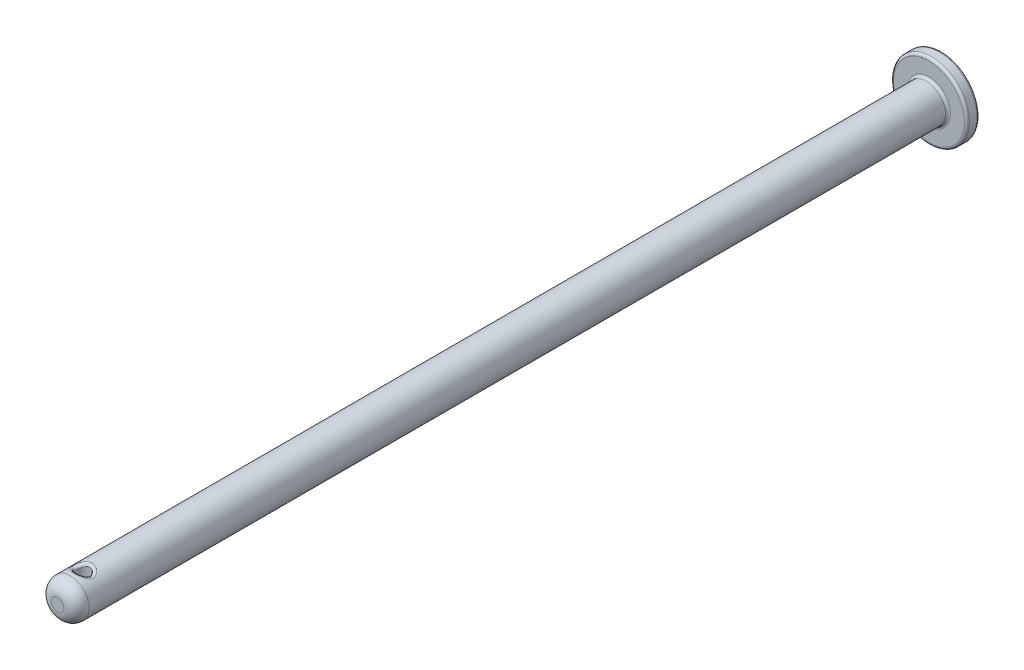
ISO-10303-21;
HEADER;
FILE_DESCRIPTION(('STEP AP214'),'2;1');
FILE_NAME('part.step','',(''),(''),'','','');
FILE_SCHEMA(('AUTOMOTIVE_DESIGN { 1 0 10303 214 1 1 1 1 }'));
ENDSEC;
DATA;
#1=APPLICATION_CONTEXT('core data for automotive mechanical design processes');
#2=APPLICATION_PROTOCOL_DEFINITION('international standard','automotive_design',2000,#1);
#3=PRODUCT_CONTEXT('',#1,'mechanical');
#4=PRODUCT('Part','Part','',(#3));
#5=PRODUCT_RELATED_PRODUCT_CATEGORY('part','',(#4));
#6=PRODUCT_DEFINITION_FORMATION('','',#4);
#7=PRODUCT_DEFINITION_CONTEXT('part definition',#1,'design');
#8=PRODUCT_DEFINITION('design','',#6,#7);
#9=PRODUCT_DEFINITION_SHAPE('','',#8);
#10=(LENGTH_UNIT() NAMED_UNIT(*) SI_UNIT(.MILLI.,.METRE.));
#11=(NAMED_UNIT(*) PLANE_ANGLE_UNIT() SI_UNIT($,.RADIAN.));
#12=(NAMED_UNIT(*) SI_UNIT($,.STERADIAN.) SOLID_ANGLE_UNIT());
#13=UNCERTAINTY_MEASURE_WITH_UNIT(LENGTH_MEASURE(1.E-05),#10,'distance_accuracy_value','');
#14=(GEOMETRIC_REPRESENTATION_CONTEXT(3) GLOBAL_UNCERTAINTY_ASSIGNED_CONTEXT((#13)) GLOBAL_UNIT_ASSIGNED_CONTEXT((#10,
#11,#12)) REPRESENTATION_CONTEXT('',''));
#15=CARTESIAN_POINT('',(0.,0.,0.));
#16=DIRECTION('',(0.,0.,1.));
#17=DIRECTION('',(1.,0.,0.));
#18=AXIS2_PLACEMENT_3D('',#15,#16,#17);
#19=CARTESIAN_POINT('',(0.,0.,350.));
#20=DIRECTION('',(0.,0.,-1.));
#21=DIRECTION('',(-1.,0.,0.));
#22=AXIS2_PLACEMENT_3D('',#19,#20,#21);
#23=CYLINDRICAL_SURFACE('',#22,7.5);
#24=CARTESIAN_POINT('',(0.,0.,6.00000000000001));
#25=DIRECTION('',(0.,0.,-1.));
#26=DIRECTION('',(-1.,0.,0.));
#27=AXIS2_PLACEMENT_3D('',#24,#25,#26);
#28=CIRCLE('',#27,7.5);
#29=CARTESIAN_POINT('',(-7.5,0.,6.00000000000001));
#30=VERTEX_POINT('',#29);
#31=EDGE_CURVE('E55',#30,#30,#28,.F.);
#32=ORIENTED_EDGE('',*,*,#31,.T.);
#33=EDGE_LOOP('',(#32));
#34=FACE_BOUND('',#33,.T.);
#35=CARTESIAN_POINT('',(0.,0.,345.));
#36=DIRECTION('',(0.,0.,1.));
#37=DIRECTION('',(1.,0.,0.));
#38=AXIS2_PLACEMENT_3D('',#35,#36,#37);
#39=CIRCLE('',#38,7.5);
#40=CARTESIAN_POINT('',(7.5,0.,345.));
#41=VERTEX_POINT('',#40);
#42=EDGE_CURVE('E158',#41,#41,#39,.F.);
#43=ORIENTED_EDGE('',*,*,#42,.T.);
#44=EDGE_LOOP('',(#43));
#45=FACE_BOUND('',#44,.T.);
#46=CARTESIAN_POINT('',(-1.13147029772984,-6.3083757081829,342.340891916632));
#47=CARTESIAN_POINT('',(-1.21896186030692,-6.74298137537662,342.298602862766));
#48=CARTESIAN_POINT('',(-1.42153998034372,-7.0337308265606,342.568328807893));
#49=CARTESIAN_POINT('',(-1.62411810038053,-7.32448027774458,342.83805475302));
#50=CARTESIAN_POINT('',(-1.80767444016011,-7.27889504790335,343.241234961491));
#51=CARTESIAN_POINT('',(-0.996126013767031,-6.35491191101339,342.40630605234));
#52=CARTESIAN_POINT('',(-1.07672419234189,-6.78407323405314,342.373570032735));
#53=CARTESIAN_POINT('',(-1.25353230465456,-7.07545097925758,342.649530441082));
#54=CARTESIAN_POINT('',(-1.43128214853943,-7.36659199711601,342.925032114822));
#55=CARTESIAN_POINT('',(-1.59144392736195,-7.33259066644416,343.331808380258));
#56=CARTESIAN_POINT('',(-0.854083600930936,-6.39483004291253,342.460452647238));
#57=CARTESIAN_POINT('',(-0.925012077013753,-6.81978212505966,342.436626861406));
#58=CARTESIAN_POINT('',(-1.07597523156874,-7.11153730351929,342.717314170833));
#59=CARTESIAN_POINT('',(-1.22760387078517,-7.40319473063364,342.997818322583));
#60=CARTESIAN_POINT('',(-1.36451226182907,-7.37865004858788,343.406780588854));
#61=CARTESIAN_POINT('',(-0.560870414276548,-6.45669378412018,342.543336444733));
#62=CARTESIAN_POINT('',(-0.609585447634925,-6.87517266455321,342.533316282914));
#63=CARTESIAN_POINT('',(-0.707872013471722,-7.16762665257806,342.821366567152));
#64=CARTESIAN_POINT('',(-0.806827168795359,-7.45997513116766,343.109222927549));
#65=CARTESIAN_POINT('',(-0.896065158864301,-7.4500312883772,343.521542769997));
#66=CARTESIAN_POINT('',(-0.409710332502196,-6.4786600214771,342.572102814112));
#67=CARTESIAN_POINT('',(-0.44559053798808,-6.89498979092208,342.567192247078));
#68=CARTESIAN_POINT('',(-0.517341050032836,-7.18764813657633,342.857671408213));
#69=CARTESIAN_POINT('',(-0.589342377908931,-7.48029165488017,343.148122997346));
#70=CARTESIAN_POINT('',(-0.654566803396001,-7.47537694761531,343.561373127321));
#71=CARTESIAN_POINT('',(-0.122346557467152,-6.50047366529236,342.600638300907));
#72=CARTESIAN_POINT('',(-0.133309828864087,-6.91463191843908,342.60073507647));
#73=CARTESIAN_POINT('',(-0.154607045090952,-7.20753557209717,342.893693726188));
#74=CARTESIAN_POINT('',(-0.176110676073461,-7.50042885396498,343.186634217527));
#75=CARTESIAN_POINT('',(-0.195464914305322,-7.50054653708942,343.600883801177));
#76=CARTESIAN_POINT('',(0.0134656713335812,-6.50266651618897,342.603482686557));
#77=CARTESIAN_POINT('',(0.014751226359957,-6.91661335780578,342.604092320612));
#78=CARTESIAN_POINT('',(0.0170394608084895,-7.20953871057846,342.897291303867));
#79=CARTESIAN_POINT('',(0.0194473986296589,-7.50246030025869,343.190483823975));
#80=CARTESIAN_POINT('',(0.0215132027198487,-7.50307674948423,343.604822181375));
#81=CARTESIAN_POINT('',(0.283491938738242,-6.49082945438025,342.588031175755));
#82=CARTESIAN_POINT('',(0.308456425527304,-6.90595071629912,342.585919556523));
#83=CARTESIAN_POINT('',(0.358067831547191,-7.19874156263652,342.877776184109));
#84=CARTESIAN_POINT('',(0.40779194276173,-7.49152881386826,343.169625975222));
#85=CARTESIAN_POINT('',(0.452916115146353,-7.4894186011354,343.583427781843));
#86=CARTESIAN_POINT('',(0.417706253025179,-6.4768023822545,342.569738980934));
#87=CARTESIAN_POINT('',(0.454373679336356,-6.89328926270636,342.56435995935));
#88=CARTESIAN_POINT('',(0.527450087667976,-7.18594386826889,342.854668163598));
#89=CARTESIAN_POINT('',(0.600939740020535,-7.47854807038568,343.144884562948));
#90=CARTESIAN_POINT('',(0.667341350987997,-7.47323351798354,343.558100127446));
#91=CARTESIAN_POINT('',(0.673937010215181,-6.43503035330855,342.51438894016));
#92=CARTESIAN_POINT('',(0.731303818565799,-6.85579430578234,342.499571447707));
#93=CARTESIAN_POINT('',(0.849951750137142,-7.14797328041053,342.785003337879));
#94=CARTESIAN_POINT('',(0.968970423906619,-7.44011027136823,343.070357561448));
#95=CARTESIAN_POINT('',(1.07670409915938,-7.42503502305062,343.481461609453));
#96=CARTESIAN_POINT('',(0.796228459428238,-6.40799781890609,342.478303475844));
#97=CARTESIAN_POINT('',(0.862914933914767,-6.83153298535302,342.457360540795));
#98=CARTESIAN_POINT('',(1.00346117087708,-7.12344342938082,342.739662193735));
#99=CARTESIAN_POINT('',(1.14457733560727,-7.41523970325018,343.02174841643));
#100=CARTESIAN_POINT('',(1.27208097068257,-7.39384363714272,343.431497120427));
#101=CARTESIAN_POINT('',(1.03289270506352,-6.34291543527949,342.389377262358));
#102=CARTESIAN_POINT('',(1.11537410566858,-6.77352068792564,342.354251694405));
#103=CARTESIAN_POINT('',(1.29920731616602,-7.06470557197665,342.628536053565));
#104=CARTESIAN_POINT('',(1.48361246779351,-7.35577784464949,342.902606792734));
#105=CARTESIAN_POINT('',(1.65018361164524,-7.31874857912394,343.308368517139));
#106=CARTESIAN_POINT('',(1.14726415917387,-6.30486372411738,342.336533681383));
#107=CARTESIAN_POINT('',(1.23635327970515,-6.73969115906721,342.293206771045));
#108=CARTESIAN_POINT('',(1.44144213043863,-7.030495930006,342.562747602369));
#109=CARTESIAN_POINT('',(1.64722598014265,-7.32110606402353,342.831903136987));
#110=CARTESIAN_POINT('',(1.8329072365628,-7.27484275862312,343.235200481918));
#111=CARTESIAN_POINT('',(1.37417591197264,-6.21757566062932,342.211260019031));
#112=CARTESIAN_POINT('',(1.47342383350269,-6.66275668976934,342.150137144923));
#113=CARTESIAN_POINT('',(1.72173314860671,-6.95262519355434,342.408001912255));
#114=CARTESIAN_POINT('',(1.97084460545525,-7.2422725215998,342.665425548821));
#115=CARTESIAN_POINT('',(2.19542897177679,-7.17412576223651,343.061744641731));
#116=CARTESIAN_POINT('',(1.48594513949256,-6.16771728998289,342.1376641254));
#117=CARTESIAN_POINT('',(1.588501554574,-6.61907390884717,342.066726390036));
#118=CARTESIAN_POINT('',(1.85868879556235,-6.90844987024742,342.317683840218));
#119=CARTESIAN_POINT('',(2.12972178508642,-7.19751985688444,342.567983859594));
#120=CARTESIAN_POINT('',(2.373995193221,-7.11659687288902,342.959842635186));
#121=CARTESIAN_POINT('',(1.69622012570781,-6.06283884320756,341.974977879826));
#122=CARTESIAN_POINT('',(1.80104214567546,-6.52831486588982,341.885399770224));
#123=CARTESIAN_POINT('',(2.11368111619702,-6.81659733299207,342.120401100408));
#124=CARTESIAN_POINT('',(2.42717767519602,-7.10457221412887,342.354742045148));
#125=CARTESIAN_POINT('',(2.70993747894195,-6.99558328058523,342.734584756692));
#126=CARTESIAN_POINT('',(1.79471433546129,-6.00781434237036,341.885874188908));
#127=CARTESIAN_POINT('',(1.89846587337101,-6.48117233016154,341.787292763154));
#128=CARTESIAN_POINT('',(2.23170133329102,-6.76891712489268,342.013422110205));
#129=CARTESIAN_POINT('',(2.56573470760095,-7.05630961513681,342.23870724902));
#130=CARTESIAN_POINT('',(2.86729509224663,-6.93209347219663,342.611210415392));
#131=CARTESIAN_POINT('',(1.98774196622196,-5.89056800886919,341.68249653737));
#132=CARTESIAN_POINT('',(2.08483879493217,-6.38226084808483,341.56809555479));
#133=CARTESIAN_POINT('',(2.45969907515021,-6.66890111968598,341.77318858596));
#134=CARTESIAN_POINT('',(2.83555834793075,-6.95510573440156,341.977232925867));
#135=CARTESIAN_POINT('',(3.17568243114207,-6.79680924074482,342.329610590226));
#136=CARTESIAN_POINT('',(2.08043429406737,-5.82826353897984,341.56649281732));
#137=CARTESIAN_POINT('',(2.17119844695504,-6.33063472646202,341.445603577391));
#138=CARTESIAN_POINT('',(2.56708123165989,-6.61668041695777,341.638323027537));
#139=CARTESIAN_POINT('',(2.96374790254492,-6.90231800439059,341.829852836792));
#140=CARTESIAN_POINT('',(3.32377076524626,-6.72491946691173,342.168990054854));
#141=CARTESIAN_POINT('',(2.245344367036,-5.70973517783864,341.319272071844));
#142=CARTESIAN_POINT('',(2.31950064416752,-6.23459850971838,341.192815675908));
#143=CARTESIAN_POINT('',(2.75409147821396,-6.51961177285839,341.357979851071));
#144=CARTESIAN_POINT('',(3.18948047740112,-6.80421197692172,341.521962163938));
#145=CARTESIAN_POINT('',(3.58723656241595,-6.58815597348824,341.826684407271));
#146=CARTESIAN_POINT('',(2.3175710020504,-5.65350865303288,341.188061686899));
#147=CARTESIAN_POINT('',(2.38121666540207,-6.19026557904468,341.062506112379));
#148=CARTESIAN_POINT('',(2.8337316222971,-6.47476063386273,341.212506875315));
#149=CARTESIAN_POINT('',(3.28673143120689,-6.758973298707,341.361405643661));
#150=CARTESIAN_POINT('',(3.70262822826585,-6.52327921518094,341.645008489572));
#151=CARTESIAN_POINT('',(2.42990455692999,-5.56211682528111,340.93372901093));
#152=CARTESIAN_POINT('',(2.47341379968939,-6.11995477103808,340.819378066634));
#153=CARTESIAN_POINT('',(2.95460291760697,-6.40373710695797,340.938882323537));
#154=CARTESIAN_POINT('',(3.43615239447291,-6.68730555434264,341.057574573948));
#155=CARTESIAN_POINT('',(3.88209603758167,-6.41782710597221,341.292855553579));
#156=CARTESIAN_POINT('',(2.47321713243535,-5.52505234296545,340.812384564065));
#157=CARTESIAN_POINT('',(2.50707580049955,-6.09228732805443,340.706911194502));
#158=CARTESIAN_POINT('',(2.99982132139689,-6.37576567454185,340.811438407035));
#159=CARTESIAN_POINT('',(3.49273119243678,-6.65914080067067,340.915355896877));
#160=CARTESIAN_POINT('',(3.9512936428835,-6.37506039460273,341.124840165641));
#161=CARTESIAN_POINT('',(2.54160842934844,-5.46523222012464,340.562942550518));
#162=CARTESIAN_POINT('',(2.55871889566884,-6.04835714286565,340.482481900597));
#163=CARTESIAN_POINT('',(3.06995239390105,-6.33146180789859,340.555713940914));
#164=CARTESIAN_POINT('',(3.5813566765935,-6.61445797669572,340.628333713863));
#165=CARTESIAN_POINT('',(4.06055784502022,-6.30603717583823,340.779458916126));
#166=CARTESIAN_POINT('',(2.56670848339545,-5.44245984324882,340.43485307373));
#167=CARTESIAN_POINT('',(2.57658884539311,-6.03218195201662,340.370757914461));
#168=CARTESIAN_POINT('',(3.09488882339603,-6.31511575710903,340.427434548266));
#169=CARTESIAN_POINT('',(3.61322122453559,-6.59802912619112,340.483823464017));
#170=CARTESIAN_POINT('',(4.10065852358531,-6.27976135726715,340.602104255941));
#171=CARTESIAN_POINT('',(2.5974366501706,-5.41444701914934,340.17474125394));
#172=CARTESIAN_POINT('',(2.59833068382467,-6.01233167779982,340.147517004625));
#173=CARTESIAN_POINT('',(3.12526005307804,-6.29511493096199,340.17050471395));
#174=CARTESIAN_POINT('',(3.65222714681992,-6.57787241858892,340.1931868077));
#175=CARTESIAN_POINT('',(4.14975086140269,-6.24743886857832,340.241949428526));
#176=CARTESIAN_POINT('',(2.60297840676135,-5.40928432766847,340.042704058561));
#177=CARTESIAN_POINT('',(2.60207608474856,-6.00877018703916,340.036330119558));
#178=CARTESIAN_POINT('',(3.13060836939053,-6.29151643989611,340.041855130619));
#179=CARTESIAN_POINT('',(3.65914422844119,-6.57425996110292,340.047477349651));
#180=CARTESIAN_POINT('',(4.15860455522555,-6.24148191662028,340.059128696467));
#181=CARTESIAN_POINT('',(2.5939849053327,-5.41755866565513,339.779609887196));
#182=CARTESIAN_POINT('',(2.59581790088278,-6.01458101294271,339.813217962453));
#183=CARTESIAN_POINT('',(3.12180167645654,-6.29737013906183,339.78441300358));
#184=CARTESIAN_POINT('',(3.64778792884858,-6.58015797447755,339.755687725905));
#185=CARTESIAN_POINT('',(4.14423623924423,-6.25102922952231,339.694844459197));
#186=CARTESIAN_POINT('',(2.57944591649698,-5.4309991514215,339.648553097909));
#187=CARTESIAN_POINT('',(2.58583090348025,-6.02393784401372,339.70163901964));
#188=CARTESIAN_POINT('',(3.10764304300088,-6.30682475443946,339.655620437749));
#189=CARTESIAN_POINT('',(3.6295447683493,-6.58965272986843,339.610060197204));
#190=CARTESIAN_POINT('',(4.12100826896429,-6.26653748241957,339.513381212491));
#191=CARTESIAN_POINT('',(2.5328395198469,-5.47286070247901,339.400335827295));
#192=CARTESIAN_POINT('',(2.55201168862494,-6.0540130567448,339.484686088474));
#193=CARTESIAN_POINT('',(3.06092277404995,-6.33713488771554,339.406917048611));
#194=CARTESIAN_POINT('',(3.56990414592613,-6.62021187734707,339.329539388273));
#195=CARTESIAN_POINT('',(4.0465483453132,-6.31483927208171,339.169695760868));
#196=CARTESIAN_POINT('',(2.50202946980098,-5.50020249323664,339.282836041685));
#197=CARTESIAN_POINT('',(2.52925129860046,-6.07384342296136,339.379677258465));
#198=CARTESIAN_POINT('',(3.02967613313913,-6.35717259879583,339.286997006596));
#199=CARTESIAN_POINT('',(3.53031040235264,-6.64037223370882,339.194932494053));
#200=CARTESIAN_POINT('',(3.99732518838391,-6.34638749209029,339.007003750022));
#201=CARTESIAN_POINT('',(2.42506222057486,-5.56589816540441,339.054705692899));
#202=CARTESIAN_POINT('',(2.46924998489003,-6.12295269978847,339.169587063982));
#203=CARTESIAN_POINT('',(2.94929967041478,-6.4067211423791,339.048785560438));
#204=CARTESIAN_POINT('',(3.42955457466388,-6.69036350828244,338.928597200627));
#205=CARTESIAN_POINT('',(3.87435976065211,-6.42219019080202,338.691130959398));
#206=CARTESIAN_POINT('',(2.37889963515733,-5.60425591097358,338.944077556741));
#207=CARTESIAN_POINT('',(2.43212404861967,-6.15214899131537,339.064666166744));
#208=CARTESIAN_POINT('',(2.90016357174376,-6.43623529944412,338.930494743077));
#209=CARTESIAN_POINT('',(3.36857243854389,-6.72011007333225,338.797058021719));
#210=CARTESIAN_POINT('',(3.8006088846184,-6.46644912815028,338.537953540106));
#211=CARTESIAN_POINT('',(2.26678516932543,-5.69278774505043,338.719732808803));
#212=CARTESIAN_POINT('',(2.33760888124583,-6.22130072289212,338.845930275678));
#213=CARTESIAN_POINT('',(2.77766322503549,-6.50609777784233,338.685385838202));
#214=CARTESIAN_POINT('',(3.21816121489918,-6.79064280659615,338.525733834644));
#215=CARTESIAN_POINT('',(3.62149109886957,-6.56860124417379,338.227322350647));
#216=CARTESIAN_POINT('',(2.19922426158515,-5.74379424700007,338.606994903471));
#217=CARTESIAN_POINT('',(2.2785875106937,-6.26201572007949,338.732399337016));
#218=CARTESIAN_POINT('',(2.70224126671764,-6.5472765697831,338.559044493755));
#219=CARTESIAN_POINT('',(3.12654086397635,-6.83221071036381,338.38659898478));
#220=CARTESIAN_POINT('',(3.51355355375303,-6.62745489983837,338.071223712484));
#221=CARTESIAN_POINT('',(2.04847618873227,-5.84968516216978,338.393498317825));
#222=CARTESIAN_POINT('',(2.14133860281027,-6.34841717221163,338.512085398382));
#223=CARTESIAN_POINT('',(2.53006287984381,-6.63462194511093,338.315196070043));
#224=CARTESIAN_POINT('',(2.91942941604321,-6.9204999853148,338.119221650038));
#225=CARTESIAN_POINT('',(3.27271343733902,-6.74963672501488,337.775613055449));
#226=CARTESIAN_POINT('',(1.96527616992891,-5.90457274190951,338.292749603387));
#227=CARTESIAN_POINT('',(2.06324988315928,-6.39406330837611,338.40527677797));
#228=CARTESIAN_POINT('',(2.43328889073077,-6.68079261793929,338.197696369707));
#229=CARTESIAN_POINT('',(2.80411400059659,-6.96717967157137,337.990930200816));
#230=CARTESIAN_POINT('',(3.1397903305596,-6.81296854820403,337.636114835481));
#231=CARTESIAN_POINT('',(1.77141550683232,-6.02150562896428,338.09096860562));
#232=CARTESIAN_POINT('',(1.87583703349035,-6.49274310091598,338.187667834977));
#233=CARTESIAN_POINT('',(2.20401975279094,-6.78066762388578,337.959063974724));
#234=CARTESIAN_POINT('',(2.53321419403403,-7.06815120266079,337.731517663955));
#235=CARTESIAN_POINT('',(2.83007211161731,-6.94789111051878,337.356725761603));
#236=CARTESIAN_POINT('',(1.65852039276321,-6.08342954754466,337.992030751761));
#237=CARTESIAN_POINT('',(1.76364464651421,-6.54596396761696,338.078250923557));
#238=CARTESIAN_POINT('',(2.06837517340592,-6.83449008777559,337.839893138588));
#239=CARTESIAN_POINT('',(2.3741966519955,-7.12264235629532,337.602327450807));
#240=CARTESIAN_POINT('',(2.64970713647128,-7.01934178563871,337.219734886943));
#241=CARTESIAN_POINT('',(1.41606440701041,-6.19976838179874,337.814292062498));
#242=CARTESIAN_POINT('',(1.51700625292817,-6.6469929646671,337.879215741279));
#243=CARTESIAN_POINT('',(1.77329725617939,-6.93674523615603,337.623575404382));
#244=CARTESIAN_POINT('',(2.030667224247,-7.22611943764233,337.368733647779));
#245=CARTESIAN_POINT('',(2.26235141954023,-7.15357890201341,336.973635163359));
#246=CARTESIAN_POINT('',(1.28651138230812,-6.25418680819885,337.735481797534));
#247=CARTESIAN_POINT('',(1.3825820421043,-6.69490497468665,337.789321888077));
#248=CARTESIAN_POINT('',(1.6138751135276,-6.98518043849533,337.526418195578));
#249=CARTESIAN_POINT('',(1.84614297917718,-7.27521146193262,337.263994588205));
#250=CARTESIAN_POINT('',(2.05537321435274,-7.21636939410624,336.86451325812));
#251=CARTESIAN_POINT('',(1.03046791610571,-6.3437697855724,337.609202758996));
#252=CARTESIAN_POINT('',(1.11297987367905,-6.77420611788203,337.644268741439));
#253=CARTESIAN_POINT('',(1.29625531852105,-7.0654387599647,337.36976601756));
#254=CARTESIAN_POINT('',(1.48028416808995,-7.3564793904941,337.095635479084));
#255=CARTESIAN_POINT('',(1.64630968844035,-7.3197343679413,336.689665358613));
#256=CARTESIAN_POINT('',(0.905580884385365,-6.38048332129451,337.559063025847));
#257=CARTESIAN_POINT('',(0.979929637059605,-6.8069825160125,337.586029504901));
#258=CARTESIAN_POINT('',(1.14034545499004,-7.098575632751,337.307098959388));
#259=CARTESIAN_POINT('',(1.30133053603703,-7.3900749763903,337.028344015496));
#260=CARTESIAN_POINT('',(1.44678602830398,-7.36209613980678,336.620241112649));
#261=CARTESIAN_POINT('',(0.64802066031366,-6.44030426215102,337.478445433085));
#262=CARTESIAN_POINT('',(0.703550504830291,-6.86047433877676,337.492152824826));
#263=CARTESIAN_POINT('',(0.817444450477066,-7.15273924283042,337.206030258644));
#264=CARTESIAN_POINT('',(0.931905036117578,-7.44490739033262,336.920087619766));
#265=CARTESIAN_POINT('',(1.03529927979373,-7.43112030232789,336.508616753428));
#266=CARTESIAN_POINT('',(0.515353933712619,-6.46342279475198,337.447951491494));
#267=CARTESIAN_POINT('',(0.560039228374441,-6.88128577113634,337.456340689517));
#268=CARTESIAN_POINT('',(0.650462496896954,-7.17377588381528,337.167608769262));
#269=CARTESIAN_POINT('',(0.741179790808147,-7.46624261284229,336.878920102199));
#270=CARTESIAN_POINT('',(0.823346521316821,-7.45779553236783,336.46639437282));
#271=CARTESIAN_POINT('',(0.251557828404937,-6.49313831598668,337.408909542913));
#272=CARTESIAN_POINT('',(0.273884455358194,-6.90801367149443,337.410514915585));
#273=CARTESIAN_POINT('',(0.317794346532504,-7.20084021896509,337.118373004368));
#274=CARTESIAN_POINT('',(0.361981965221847,-7.49364365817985,336.826272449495));
#275=CARTESIAN_POINT('',(0.401897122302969,-7.49208267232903,336.412336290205));
#276=CARTESIAN_POINT('',(0.120594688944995,-6.50038352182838,337.399500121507));
#277=CARTESIAN_POINT('',(0.131229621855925,-6.91455914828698,337.39941177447));
#278=CARTESIAN_POINT('',(0.152344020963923,-7.20745672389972,337.106475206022));
#279=CARTESIAN_POINT('',(0.173447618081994,-7.50035430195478,336.813538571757));
#280=CARTESIAN_POINT('',(0.192666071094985,-7.50044252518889,336.399307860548));
#281=CARTESIAN_POINT('',(-0.14123341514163,-6.49958506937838,337.40054083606));
#282=CARTESIAN_POINT('',(-0.153695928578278,-6.91383966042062,337.400636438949));
#283=CARTESIAN_POINT('',(-0.178416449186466,-7.20672818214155,337.107790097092));
#284=CARTESIAN_POINT('',(-0.203141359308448,-7.49961666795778,336.814943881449));
#285=CARTESIAN_POINT('',(-0.225639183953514,-7.49952123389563,336.400748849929));
#286=CARTESIAN_POINT('',(-0.272098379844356,-6.49154142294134,337.41099095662));
#287=CARTESIAN_POINT('',(-0.296216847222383,-6.90657344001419,337.412966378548));
#288=CARTESIAN_POINT('',(-0.343726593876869,-7.19938314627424,337.121002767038));
#289=CARTESIAN_POINT('',(-0.391526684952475,-7.49216710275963,336.829085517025));
#290=CARTESIAN_POINT('',(-0.434713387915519,-7.49024010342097,336.415218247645));
#291=CARTESIAN_POINT('',(-0.529641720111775,-6.46097471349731,337.451187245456));
#292=CARTESIAN_POINT('',(-0.575479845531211,-6.879086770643,337.460131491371));
#293=CARTESIAN_POINT('',(-0.668446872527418,-7.17154927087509,337.171683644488));
#294=CARTESIAN_POINT('',(-0.76169786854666,-7.46398829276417,336.883279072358));
#295=CARTESIAN_POINT('',(-0.846173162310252,-7.45497082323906,336.470874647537));
#296=CARTESIAN_POINT('',(-0.656327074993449,-6.43847722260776,337.480899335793));
#297=CARTESIAN_POINT('',(-0.712458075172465,-6.8588430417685,337.495006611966));
#298=CARTESIAN_POINT('',(-0.827866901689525,-7.15108364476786,337.209109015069));
#299=CARTESIAN_POINT('',(-0.94379675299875,-7.44323518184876,336.923376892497));
#300=CARTESIAN_POINT('',(-1.04856988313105,-7.42901217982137,336.512014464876));
#301=CARTESIAN_POINT('',(-0.902531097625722,-6.38108702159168,337.558257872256));
#302=CARTESIAN_POINT('',(-0.976622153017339,-6.80752736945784,337.585082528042));
#303=CARTESIAN_POINT('',(-1.13651300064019,-7.09912359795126,337.306087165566));
#304=CARTESIAN_POINT('',(-1.29692461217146,-7.3906335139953,337.027253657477));
#305=CARTESIAN_POINT('',(-1.44191358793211,-7.36279271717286,336.619126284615));
#306=CARTESIAN_POINT('',(-1.02204753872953,-6.34619048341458,337.605909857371));
#307=CARTESIAN_POINT('',(-1.10397189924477,-6.77637649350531,337.640426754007));
#308=CARTESIAN_POINT('',(-1.28573590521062,-7.06762577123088,337.365646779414));
#309=CARTESIAN_POINT('',(-1.468180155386,-7.35870406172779,337.091198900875));
#310=CARTESIAN_POINT('',(-1.63285701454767,-7.32252748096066,336.685105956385));
#311=CARTESIAN_POINT('',(-1.25563287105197,-6.26547644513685,337.719457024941));
#312=CARTESIAN_POINT('',(-1.35008255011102,-6.70491010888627,337.7709024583));
#313=CARTESIAN_POINT('',(-1.57563890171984,-6.99527809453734,337.506570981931));
#314=CARTESIAN_POINT('',(-1.80192876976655,-7.2854643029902,337.242594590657));
#315=CARTESIAN_POINT('',(-2.00604068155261,-7.22939589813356,336.842325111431));
#316=CARTESIAN_POINT('',(-1.36934161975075,-6.21930559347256,337.785956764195));
#317=CARTESIAN_POINT('',(-1.46843386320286,-6.664216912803,337.846853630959));
#318=CARTESIAN_POINT('',(-1.71580552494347,-6.95412782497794,337.588654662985));
#319=CARTESIAN_POINT('',(-1.96398928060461,-7.24376741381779,337.331019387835));
#320=CARTESIAN_POINT('',(-2.18770554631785,-7.17612183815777,336.934401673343));
#321=CARTESIAN_POINT('',(-1.58457672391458,-6.12053097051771,337.934514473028));
#322=CARTESIAN_POINT('',(-1.68883296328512,-6.5781239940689,338.014024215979));
#323=CARTESIAN_POINT('',(-1.97873220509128,-6.86698516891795,337.770132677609));
#324=CARTESIAN_POINT('',(-2.26944759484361,-7.15557802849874,337.526801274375));
#325=CARTESIAN_POINT('',(-2.53157228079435,-7.06215111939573,337.140096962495));
#326=CARTESIAN_POINT('',(-1.68609468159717,-6.067922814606,338.016583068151));
#327=CARTESIAN_POINT('',(-1.79087882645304,-6.53264830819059,338.105433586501));
#328=CARTESIAN_POINT('',(-2.101480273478,-6.82098948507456,337.869538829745));
#329=CARTESIAN_POINT('',(-2.41286997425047,-7.10900789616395,337.634388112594));
#330=CARTESIAN_POINT('',(-2.69376073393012,-7.00144940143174,337.253730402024));
#331=CARTESIAN_POINT('',(-1.83377006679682,-5.9841012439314,338.155388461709));
#332=CARTESIAN_POINT('',(-1.93592034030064,-6.46131127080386,338.256840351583));
#333=CARTESIAN_POINT('',(-2.27781886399,-6.74870228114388,338.035280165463));
#334=CARTESIAN_POINT('',(-2.61997177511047,-7.03598880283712,337.813957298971));
#335=CARTESIAN_POINT('',(-2.92969182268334,-6.90473220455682,337.445922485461));
#336=CARTESIAN_POINT('',(-1.8846595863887,-5.95363903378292,338.20742053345));
#337=CARTESIAN_POINT('',(-1.98527492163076,-6.43553782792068,338.313166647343));
#338=CARTESIAN_POINT('',(-2.33810594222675,-6.72262897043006,338.096965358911));
#339=CARTESIAN_POINT('',(-2.69117125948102,-7.009614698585,337.881022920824));
#340=CARTESIAN_POINT('',(-3.01099460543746,-6.86958350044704,337.517966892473));
#341=CARTESIAN_POINT('',(-1.98186221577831,-5.8928152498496,338.315510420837));
#342=CARTESIAN_POINT('',(-2.0781860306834,-6.38452094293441,338.428787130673));
#343=CARTESIAN_POINT('',(-2.45228648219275,-6.67102687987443,338.223934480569));
#344=CARTESIAN_POINT('',(-2.82662222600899,-6.95742600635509,338.019345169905));
#345=CARTESIAN_POINT('',(-3.16628874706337,-6.79940221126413,337.667629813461));
#346=CARTESIAN_POINT('',(-2.02817956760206,-5.86245360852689,338.371564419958));
#347=CARTESIAN_POINT('',(-2.12172855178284,-6.35927673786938,338.488096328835));
#348=CARTESIAN_POINT('',(-2.50618587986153,-6.64549761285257,338.28921498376));
#349=CARTESIAN_POINT('',(-2.89085808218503,-6.93161069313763,338.090621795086));
#350=CARTESIAN_POINT('',(-3.24028688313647,-6.76436954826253,337.745243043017));
#351=CARTESIAN_POINT('',(-2.16012583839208,-5.77257728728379,338.545680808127));
#352=CARTESIAN_POINT('',(-2.24390678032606,-6.28517673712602,338.670132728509));
#353=CARTESIAN_POINT('',(-2.65818672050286,-6.57072671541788,338.489808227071));
#354=CARTESIAN_POINT('',(-3.0733102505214,-6.85586594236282,338.310587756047));
#355=CARTESIAN_POINT('',(-3.45108861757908,-6.66066610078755,337.986327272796));
#356=CARTESIAN_POINT('',(-2.23869586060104,-5.71430265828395,338.669647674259));
#357=CARTESIAN_POINT('',(-2.31338125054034,-6.23832176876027,338.796211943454));
#358=CARTESIAN_POINT('',(-2.74652746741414,-6.52332922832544,338.629812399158));
#359=CARTESIAN_POINT('',(-3.18025104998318,-6.80801466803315,338.464520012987));
#360=CARTESIAN_POINT('',(-3.57661468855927,-6.59342614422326,338.157973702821));
#361=CARTESIAN_POINT('',(-2.34190161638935,-5.6336940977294,338.868022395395));
#362=CARTESIAN_POINT('',(-2.40104514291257,-6.1751246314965,338.990620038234));
#363=CARTESIAN_POINT('',(-2.85988793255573,-6.45937992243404,338.847680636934));
#364=CARTESIAN_POINT('',(-3.31889460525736,-6.74354083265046,338.70505750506));
#365=CARTESIAN_POINT('',(-3.74149962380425,-6.50041626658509,338.432646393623));
#366=CARTESIAN_POINT('',(-2.37433684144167,-5.60752247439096,338.937700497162));
#367=CARTESIAN_POINT('',(-2.4278879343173,-6.15488752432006,339.057828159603));
#368=CARTESIAN_POINT('',(-2.8949615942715,-6.43893331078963,338.923160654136));
#369=CARTESIAN_POINT('',(-3.36215287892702,-6.72290854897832,338.788778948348));
#370=CARTESIAN_POINT('',(-3.79331921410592,-6.470218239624,338.529123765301));
#371=CARTESIAN_POINT('',(-2.4331007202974,-5.55901891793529,339.08024397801));
#372=CARTESIAN_POINT('',(-2.47544856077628,-6.11786012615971,339.192753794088));
#373=CARTESIAN_POINT('',(-2.95766597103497,-6.40155463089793,339.075266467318));
#374=CARTESIAN_POINT('',(-3.43999942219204,-6.68518039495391,338.958060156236));
#375=CARTESIAN_POINT('',(-3.88720233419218,-6.41425259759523,338.72649166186));
#376=CARTESIAN_POINT('',(-2.45943316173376,-5.53668460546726,339.153107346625));
#377=CARTESIAN_POINT('',(-2.49613570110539,-6.10108961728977,339.26043991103));
#378=CARTESIAN_POINT('',(-2.98530130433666,-6.38462038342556,339.151891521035));
#379=CARTESIAN_POINT('',(-3.47454167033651,-6.66810475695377,339.043584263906));
#380=CARTESIAN_POINT('',(-3.92927191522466,-6.38848223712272,338.827379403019));
#381=CARTESIAN_POINT('',(-2.50559556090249,-5.49686045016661,339.301418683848));
#382=CARTESIAN_POINT('',(-2.53164312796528,-6.07154254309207,339.39571209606));
#383=CARTESIAN_POINT('',(-3.03314027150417,-6.35481367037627,339.305583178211));
#384=CARTESIAN_POINT('',(-3.53471335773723,-6.63803729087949,339.215697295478));
#385=CARTESIAN_POINT('',(-4.00302249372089,-6.34253128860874,339.032733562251));
#386=CARTESIAN_POINT('',(-2.52543497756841,-5.47936356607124,339.376862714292));
#387=CARTESIAN_POINT('',(-2.54644137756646,-6.05878281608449,339.463251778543));
#388=CARTESIAN_POINT('',(-3.05335472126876,-6.34193529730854,339.382648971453));
#389=CARTESIAN_POINT('',(-3.5603071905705,-6.62506263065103,339.302229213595));
#390=CARTESIAN_POINT('',(-4.03471860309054,-6.32234257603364,339.13719452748));
#391=CARTESIAN_POINT('',(-2.55832057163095,-5.45003849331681,339.529780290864));
#392=CARTESIAN_POINT('',(-2.57057080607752,-6.03758914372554,339.598050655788));
#393=CARTESIAN_POINT('',(-3.08653157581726,-6.32056826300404,339.536912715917));
#394=CARTESIAN_POINT('',(-3.60253206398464,-6.60352175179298,339.475958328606));
#395=CARTESIAN_POINT('',(-4.08725771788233,-6.28850595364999,339.34892655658));
#396=CARTESIAN_POINT('',(-2.57136826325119,-5.43820904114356,339.607253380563));
#397=CARTESIAN_POINT('',(-2.57987959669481,-6.02917383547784,339.665250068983));
#398=CARTESIAN_POINT('',(-3.0994955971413,-6.31207862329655,339.614110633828));
#399=CARTESIAN_POINT('',(-3.61912523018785,-6.59497450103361,339.563080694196));
#400=CARTESIAN_POINT('',(-4.10810314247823,-6.27485658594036,339.456196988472));
#401=CARTESIAN_POINT('',(-2.58909106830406,-5.42205746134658,339.752608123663));
#402=CARTESIAN_POINT('',(-2.59241656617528,-6.01773430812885,339.790075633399));
#403=CARTESIAN_POINT('',(-3.11701128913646,-6.30054965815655,339.757769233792));
#404=CARTESIAN_POINT('',(-3.64161585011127,-6.58335847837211,339.725545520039));
#405=CARTESIAN_POINT('',(-4.13641768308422,-6.25622014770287,339.657457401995));
#406=CARTESIAN_POINT('',(-2.59467503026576,-5.41692290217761,339.82033325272));
#407=CARTESIAN_POINT('',(-2.59629907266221,-6.01413313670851,339.847702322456));
#408=CARTESIAN_POINT('',(-3.12247891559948,-6.29691862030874,339.824237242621));
#409=CARTESIAN_POINT('',(-3.64865996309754,-6.57970331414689,339.800801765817));
#410=CARTESIAN_POINT('',(-4.14533880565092,-6.25029565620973,339.751230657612));
#411=CARTESIAN_POINT('',(-2.60051847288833,-5.41154835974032,339.956139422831));
#412=CARTESIAN_POINT('',(-2.60036344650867,-6.0103614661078,339.962917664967));
#413=CARTESIAN_POINT('',(-3.12819921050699,-6.29311875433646,339.957171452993));
#414=CARTESIAN_POINT('',(-3.65603632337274,-6.57587513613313,339.951454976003));
#415=CARTESIAN_POINT('',(-4.15467448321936,-6.24409426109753,339.939269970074));
#416=CARTESIAN_POINT('',(-2.60077627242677,-5.41130992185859,340.024220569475));
#417=CARTESIAN_POINT('',(-2.60054083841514,-6.01019511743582,340.020459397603));
#418=CARTESIAN_POINT('',(-3.12845023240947,-6.29295101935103,340.023637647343));
#419=CARTESIAN_POINT('',(-3.65636045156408,-6.57570633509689,340.026790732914));
#420=CARTESIAN_POINT('',(-4.15508635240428,-6.24381914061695,340.033536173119));
#421=CARTESIAN_POINT('',(-2.59595673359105,-5.41574500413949,340.160078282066));
#422=CARTESIAN_POINT('',(-2.59719159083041,-6.01330614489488,340.135654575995));
#423=CARTESIAN_POINT('',(-3.12373449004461,-6.29608531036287,340.156563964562));
#424=CARTESIAN_POINT('',(-3.65027830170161,-6.57886390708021,340.177449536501));
#425=CARTESIAN_POINT('',(-4.14738649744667,-6.248936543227,340.221646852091));
#426=CARTESIAN_POINT('',(-2.59088197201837,-5.4204161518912,340.227854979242));
#427=CARTESIAN_POINT('',(-2.59366946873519,-6.01657932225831,340.193260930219));
#428=CARTESIAN_POINT('',(-3.11877024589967,-6.2993856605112,340.223024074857));
#429=CARTESIAN_POINT('',(-3.64388023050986,-6.58218601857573,340.252711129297));
#430=CARTESIAN_POINT('',(-4.13927889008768,-6.25432632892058,340.31549150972));
#431=CARTESIAN_POINT('',(-2.57549075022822,-5.43445871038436,340.36256258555));
#432=CARTESIAN_POINT('',(-2.58280440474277,-6.02651359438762,340.308755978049));
#433=CARTESIAN_POINT('',(-3.1035779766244,-6.30939608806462,340.355981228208));
#434=CARTESIAN_POINT('',(-3.62435994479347,-6.59227296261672,340.403128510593));
#435=CARTESIAN_POINT('',(-4.1146893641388,-6.27052928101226,340.502009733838));
#436=CARTESIAN_POINT('',(-2.56517221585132,-5.44383198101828,340.429493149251));
#437=CARTESIAN_POINT('',(-2.57546853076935,-6.03316830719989,340.366600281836));
#438=CARTESIAN_POINT('',(-3.09334786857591,-6.31610751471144,340.422478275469));
#439=CARTESIAN_POINT('',(-3.61125032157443,-6.59903131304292,340.478226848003));
#440=CARTESIAN_POINT('',(-4.09820413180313,-6.28134459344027,340.594682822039));
#441=CARTESIAN_POINT('',(-2.52907134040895,-5.47621888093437,340.615304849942));
#442=CARTESIAN_POINT('',(-2.54924743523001,-6.05643852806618,340.529218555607));
#443=CARTESIAN_POINT('',(-3.05711851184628,-6.33958373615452,340.608970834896));
#444=CARTESIAN_POINT('',(-3.56507068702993,-6.62267716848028,340.68832443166));
#445=CARTESIAN_POINT('',(-4.04052817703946,-6.31871409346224,340.851960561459));
#446=CARTESIAN_POINT('',(-2.49752644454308,-5.50413997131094,340.732675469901));
#447=CARTESIAN_POINT('',(-2.52584898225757,-6.07673632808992,340.63435934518));
#448=CARTESIAN_POINT('',(-3.02505394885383,-6.36009288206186,340.728981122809));
#449=CARTESIAN_POINT('',(-3.52447704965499,-6.64331487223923,340.822980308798));
#450=CARTESIAN_POINT('',(-3.99013100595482,-6.35093073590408,341.01447372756));
#451=CARTESIAN_POINT('',(-2.41913724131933,-5.57084904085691,340.960374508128));
#452=CARTESIAN_POINT('',(-2.46451494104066,-6.12670620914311,340.844579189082));
#453=CARTESIAN_POINT('',(-2.94302136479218,-6.41051107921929,340.967213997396));
#454=CARTESIAN_POINT('',(-3.42173851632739,-6.69418692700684,341.089225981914));
#455=CARTESIAN_POINT('',(-3.8648938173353,-6.42790273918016,341.32974931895));
#456=CARTESIAN_POINT('',(-2.37228806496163,-5.60964047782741,341.070700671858));
#457=CARTESIAN_POINT('',(-2.42669617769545,-6.15629517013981,340.94950145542));
#458=CARTESIAN_POINT('',(-2.89304764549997,-6.44042312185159,341.085436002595));
#459=CARTESIAN_POINT('',(-3.35977563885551,-6.72433639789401,341.220631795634));
#460=CARTESIAN_POINT('',(-3.79004602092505,-6.47266208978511,341.48250862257));
#461=CARTESIAN_POINT('',(-2.25859608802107,-5.69904771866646,341.294693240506));
#462=CARTESIAN_POINT('',(-2.33052597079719,-6.22626374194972,341.168445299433));
#463=CARTESIAN_POINT('',(-2.76857916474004,-6.51111501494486,341.330649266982));
#464=CARTESIAN_POINT('',(-3.20708827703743,-6.79570826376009,341.49195168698));
#465=CARTESIAN_POINT('',(-3.60840795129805,-6.57582429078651,341.792652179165));
#466=CARTESIAN_POINT('',(-2.19009944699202,-5.75050198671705,341.407344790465));
#467=CARTESIAN_POINT('',(-2.27048180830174,-6.26741734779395,341.282167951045));
#468=CARTESIAN_POINT('',(-2.69196178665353,-6.55273782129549,341.457135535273));
#469=CARTESIAN_POINT('',(-3.11409962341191,-6.83772744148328,341.631190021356));
#470=CARTESIAN_POINT('',(-3.49897544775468,-6.635194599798,341.948631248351));
#471=CARTESIAN_POINT('',(-2.03744201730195,-5.85709534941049,341.62050811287));
#472=CARTESIAN_POINT('',(-2.13107170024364,-6.35454189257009,341.50262932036));
#473=CARTESIAN_POINT('',(-2.51729621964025,-6.64081726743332,341.701029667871));
#474=CARTESIAN_POINT('',(-2.90417490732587,-6.92676187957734,341.89851110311));
#475=CARTESIAN_POINT('',(-3.25508487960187,-6.75818694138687,342.243780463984));
#476=CARTESIAN_POINT('',(-1.95326949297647,-5.91223718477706,341.721010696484));
#477=CARTESIAN_POINT('',(-2.05184551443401,-6.40047422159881,341.609399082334));
#478=CARTESIAN_POINT('',(-2.41923196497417,-6.68727751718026,341.818430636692));
#479=CARTESIAN_POINT('',(-2.78741473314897,-6.97373719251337,342.026649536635));
#480=CARTESIAN_POINT('',(-3.12060806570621,-6.82181213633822,342.382937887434));
#481=CARTESIAN_POINT('',(-1.75747419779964,-6.02936331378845,341.921890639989));
#482=CARTESIAN_POINT('',(-1.8620900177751,-6.4994556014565,341.826435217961));
#483=CARTESIAN_POINT('',(-2.18734542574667,-6.78745970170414,342.056335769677));
#484=CARTESIAN_POINT('',(-2.51362104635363,-7.07502256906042,342.285184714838));
#485=CARTESIAN_POINT('',(-2.80779901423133,-6.95695766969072,342.661079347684));
#486=CARTESIAN_POINT('',(-1.64364580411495,-6.09119451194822,342.02018208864));
#487=CARTESIAN_POINT('',(-1.74872138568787,-6.55266264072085,341.935308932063));
#488=CARTESIAN_POINT('',(-2.05041165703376,-6.84126730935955,342.174869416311));
#489=CARTESIAN_POINT('',(-2.35319354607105,-7.12950182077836,342.413648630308));
#490=CARTESIAN_POINT('',(-2.62594300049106,-7.02830135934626,342.797175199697));
#491=CARTESIAN_POINT('',(-1.39933560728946,-6.20708207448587,342.196482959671));
#492=CARTESIAN_POINT('',(-1.49975544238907,-6.65339926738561,342.132993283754));
#493=CARTESIAN_POINT('',(-1.75277846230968,-6.94322853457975,342.389653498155));
#494=CARTESIAN_POINT('',(-2.00688533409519,-7.2326827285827,342.645525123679));
#495=CARTESIAN_POINT('',(-2.235624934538,-7.16201777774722,343.041284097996));
#496=CARTESIAN_POINT('',(-1.2688536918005,-6.26113838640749,342.274492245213));
#497=CARTESIAN_POINT('',(-1.36416211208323,-6.70103363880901,342.22207424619));
#498=CARTESIAN_POINT('',(-1.59207887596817,-6.99138211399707,342.485903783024));
#499=CARTESIAN_POINT('',(-1.82097051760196,-7.28149143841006,342.749265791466));
#500=CARTESIAN_POINT('',(-2.02716270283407,-7.22439044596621,343.149296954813));
#501=CARTESIAN_POINT('',(-1.13147029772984,-6.3083757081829,342.340891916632));
#502=CARTESIAN_POINT('',(-1.21896186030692,-6.74298137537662,342.298602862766));
#503=CARTESIAN_POINT('',(-1.42153998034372,-7.0337308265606,342.568328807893));
#504=CARTESIAN_POINT('',(-1.62411810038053,-7.32448027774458,342.83805475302));
#505=CARTESIAN_POINT('',(-1.80767444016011,-7.27889504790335,343.241234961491));
#506=(BOUNDED_SURFACE() B_SPLINE_SURFACE(3,2,((#46,#47,#48,#49,#50),(#51,#52,#53,#54,#55),(#56,
#57,#58,#59,#60),(#61,#62,#63,#64,#65),(#66,#67,#68,#69,#70),(#71,#72,#73,#74,#75),(#76,#77,#78,
#79,#80),(#81,#82,#83,#84,#85),(#86,#87,#88,#89,#90),(#91,#92,#93,#94,#95),(#96,#97,#98,#99,
#100),(#101,#102,#103,#104,#105),(#106,#107,#108,#109,#110),(#111,#112,#113,#114,#115),(#116,
#117,#118,#119,#120),(#121,#122,#123,#124,#125),(#126,#127,#128,#129,#130),(#131,#132,#133,#134,
#135),(#136,#137,#138,#139,#140),(#141,#142,#143,#144,#145),(#146,#147,#148,#149,#150),(#151,
#152,#153,#154,#155),(#156,#157,#158,#159,#160),(#161,#162,#163,#164,#165),(#166,#167,#168,#169,
#170),(#171,#172,#173,#174,#175),(#176,#177,#178,#179,#180),(#181,#182,#183,#184,#185),(#186,
#187,#188,#189,#190),(#191,#192,#193,#194,#195),(#196,#197,#198,#199,#200),(#201,#202,#203,#204,
#205),(#206,#207,#208,#209,#210),(#211,#212,#213,#214,#215),(#216,#217,#218,#219,#220),(#221,
#222,#223,#224,#225),(#226,#227,#228,#229,#230),(#231,#232,#233,#234,#235),(#236,#237,#238,#239,
#240),(#241,#242,#243,#244,#245),(#246,#247,#248,#249,#250),(#251,#252,#253,#254,#255),(#256,
#257,#258,#259,#260),(#261,#262,#263,#264,#265),(#266,#267,#268,#269,#270),(#271,#272,#273,#274,
#275),(#276,#277,#278,#279,#280),(#281,#282,#283,#284,#285),(#286,#287,#288,#289,#290),(#291,
#292,#293,#294,#295),(#296,#297,#298,#299,#300),(#301,#302,#303,#304,#305),(#306,#307,#308,#309,
#310),(#311,#312,#313,#314,#315),(#316,#317,#318,#319,#320),(#321,#322,#323,#324,#325),(#326,
#327,#328,#329,#330),(#331,#332,#333,#334,#335),(#336,#337,#338,#339,#340),(#341,#342,#343,#344,
#345),(#346,#347,#348,#349,#350),(#351,#352,#353,#354,#355),(#356,#357,#358,#359,#360),(#361,
#362,#363,#364,#365),(#366,#367,#368,#369,#370),(#371,#372,#373,#374,#375),(#376,#377,#378,#379,
#380),(#381,#382,#383,#384,#385),(#386,#387,#388,#389,#390),(#391,#392,#393,#394,#395),(#396,
#397,#398,#399,#400),(#401,#402,#403,#404,#405),(#406,#407,#408,#409,#410),(#411,#412,#413,#414,
#415),(#416,#417,#418,#419,#420),(#421,#422,#423,#424,#425),(#426,#427,#428,#429,#430),(#431,
#432,#433,#434,#435),(#436,#437,#438,#439,#440),(#441,#442,#443,#444,#445),(#446,#447,#448,#449,
#450),(#451,#452,#453,#454,#455),(#456,#457,#458,#459,#460),(#461,#462,#463,#464,#465),(#466,
#467,#468,#469,#470),(#471,#472,#473,#474,#475),(#476,#477,#478,#479,#480),(#481,#482,#483,#484,
#485),(#486,#487,#488,#489,#490),(#491,#492,#493,#494,#495),(#496,#497,#498,#499,#500),(#501,
#502,#503,#504,#505)),.UNSPECIFIED.,.T.,.F.,.F.) B_SPLINE_SURFACE_WITH_KNOTS((4,2,2,2,2,2,2,2,2,
2,2,2,2,2,2,2,2,2,2,2,2,2,2,2,2,2,2,2,2,2,2,2,2,2,2,2,2,2,2,2,2,2,2,2,2,4),(3,2,3),(0.,
0.638968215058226,1.27720117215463,1.83856193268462,2.39982439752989,2.93334088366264,
3.4669475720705,4.04030399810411,4.61415605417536,5.25577087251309,5.89710655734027,
6.44144984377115,6.98515449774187,7.53125679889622,8.07746057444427,8.58657298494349,
9.0958641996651,9.66069182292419,10.2259857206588,10.8735846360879,11.5208795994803,
12.0881070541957,12.6548695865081,13.198018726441,13.7411674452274,14.2833578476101,
14.8257157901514,15.3879493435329,15.9505680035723,16.266088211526,16.581312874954,
17.2120759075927,17.5404717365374,17.8686632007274,18.1963744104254,18.5240125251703,
18.8063050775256,19.0886867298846,19.370931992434,19.6532889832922,20.1627309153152,
20.6723350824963,21.2391347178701,21.8063604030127,22.4549509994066,23.1035459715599),(0.,0.5,
1.),.UNSPECIFIED.) GEOMETRIC_REPRESENTATION_ITEM() RATIONAL_B_SPLINE_SURFACE(((1.,
0.913508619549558,1.,0.913508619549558,1.),(1.,0.916074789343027,1.,0.916074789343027,1.),(1.,
0.918239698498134,1.,0.918239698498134,1.),(1.,0.921573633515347,1.,0.921573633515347,1.),(1.,
0.922743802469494,1.,0.922743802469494,1.),(1.,0.923905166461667,1.,0.923905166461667,1.),(1.,
0.924021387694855,1.,0.924021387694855,1.),(1.,0.923391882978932,1.,0.923391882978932,1.),(1.,
0.922646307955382,1.,0.922646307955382,1.),(1.,0.920407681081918,1.,0.920407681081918,1.),(1.,
0.918953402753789,1.,0.918953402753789,1.),(1.,0.915412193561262,1.,0.915412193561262,1.),(1.,
0.913325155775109,1.,0.913325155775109,1.),(1.,0.908466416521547,1.,0.908466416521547,1.),(1.,
0.9056552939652,1.,0.9056552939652,1.),(1.,0.899625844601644,1.,0.899625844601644,1.),(1.,
0.896407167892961,1.,0.896407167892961,1.),(1.,0.889393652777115,1.,0.889393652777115,1.),(1.,
0.885575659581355,1.,0.885575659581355,1.),(1.,0.878115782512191,1.,0.878115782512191,1.),(1.,
0.874473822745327,1.,0.874473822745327,1.),(1.,0.868411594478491,1.,0.868411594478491,1.),(1.,
0.865889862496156,1.,0.865889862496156,1.),(1.,0.861762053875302,1.,0.861762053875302,1.),(1.,
0.860154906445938,1.,0.860154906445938,1.),(1.,0.858171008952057,1.,0.858171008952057,1.),(1.,
0.857799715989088,1.,0.857799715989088,1.),(1.,0.858389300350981,1.,0.858389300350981,1.),(1.,
0.859350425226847,1.,0.859350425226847,1.),(1.,0.862286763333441,1.,0.862286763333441,1.),(1.,
0.864188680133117,1.,0.864188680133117,1.),(1.,0.868658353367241,1.,0.868658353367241,1.),(1.,
0.871226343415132,1.,0.871226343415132,1.),(1.,0.87701639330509,1.,0.87701639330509,1.),(1.,
0.880279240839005,1.,0.880279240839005,1.),(1.,0.886889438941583,1.,0.886889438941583,1.),(1.,
0.890236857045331,1.,0.890236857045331,1.),(1.,0.897219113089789,1.,0.897219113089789,1.),(1.,
0.900824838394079,1.,0.900824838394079,1.),(1.,0.907473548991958,1.,0.907473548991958,1.),(1.,
0.91051679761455,1.,0.91051679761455,1.),(1.,0.915463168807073,1.,0.915463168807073,1.),(1.,
0.917460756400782,1.,0.917460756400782,1.),(1.,0.920693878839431,1.,0.920693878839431,1.),(1.,
0.921930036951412,1.,0.921930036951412,1.),(1.,0.923515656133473,1.,0.923515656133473,1.),(1.,
0.923899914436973,1.,0.923899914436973,1.),(1.,0.923857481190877,1.,0.923857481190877,1.),(1.,
0.923430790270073,1.,0.923430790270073,1.),(1.,0.921799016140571,1.,0.921799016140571,1.),(1.,
0.920595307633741,1.,0.920595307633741,1.),(1.,0.917493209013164,1.,0.917493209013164,1.),(1.,
0.915594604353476,1.,0.915594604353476,1.),(1.,0.911142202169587,1.,0.911142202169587,1.),(1.,
0.908566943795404,1.,0.908566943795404,1.),(1.,0.902957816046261,1.,0.902957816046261,1.),(1.,
0.899923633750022,1.,0.899923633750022,1.),(1.,0.894987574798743,1.,0.894987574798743,1.),(1.,
0.893173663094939,1.,0.893173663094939,1.),(1.,0.889507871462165,1.,0.889507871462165,1.),(1.,
0.887656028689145,1.,0.887656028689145,1.),(1.,0.882102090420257,1.,0.882102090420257,1.),(1.,
0.878403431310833,1.,0.878403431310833,1.),(1.,0.873158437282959,1.,0.873158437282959,1.),(1.,
0.871430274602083,1.,0.871430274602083,1.),(1.,0.86818892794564,1.,0.86818892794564,1.),(1.,
0.866675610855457,1.,0.866675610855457,1.),(1.,0.86394966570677,1.,0.86394966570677,1.),(1.,
0.86273660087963,1.,0.86273660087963,1.),(1.,0.860688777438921,1.,0.860688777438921,1.),(1.,
0.859853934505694,1.,0.859853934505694,1.),(1.,0.858709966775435,1.,0.858709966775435,1.),(1.,
0.858344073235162,1.,0.858344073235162,1.),(1.,0.857961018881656,1.,0.857961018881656,1.),(1.,
0.857943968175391,1.,0.857943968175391,1.),(1.,0.858260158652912,1.,0.858260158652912,1.),(1.,
0.858593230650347,1.,0.858593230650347,1.),(1.,0.859588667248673,1.,0.859588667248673,1.),(1.,
0.860251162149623,1.,0.860251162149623,1.),(1.,0.862521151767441,1.,0.862521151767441,1.),(1.,
0.864460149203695,1.,0.864460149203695,1.),(1.,0.868991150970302,1.,0.868991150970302,1.),(1.,
0.871583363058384,1.,0.871583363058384,1.),(1.,0.877419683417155,1.,0.877419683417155,1.),(1.,
0.880704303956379,1.,0.880704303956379,1.),(1.,0.887344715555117,1.,0.887344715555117,1.),(1.,
0.890700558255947,1.,0.890700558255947,1.),(1.,0.897680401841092,1.,0.897680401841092,1.),(1.,
0.90127381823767,1.,0.90127381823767,1.),(1.,0.907885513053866,1.,0.907885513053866,1.),(1.,
0.910903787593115,1.,0.910903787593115,1.),(1.,0.913508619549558,1.,0.913508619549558,1.))) REPRESENTATION_ITEM('') SURFACE());
#507=CARTESIAN_POINT('',(-1.80767444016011,-7.27889504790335,343.241234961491));
#508=CARTESIAN_POINT('',(-1.59144392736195,-7.33259066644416,343.331808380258));
#509=CARTESIAN_POINT('',(-1.36451226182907,-7.37865004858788,343.406780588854));
#510=CARTESIAN_POINT('',(-0.896065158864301,-7.4500312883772,343.521542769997));
#511=CARTESIAN_POINT('',(-0.654566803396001,-7.47537694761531,343.561373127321));
#512=CARTESIAN_POINT('',(-0.195464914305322,-7.50054653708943,343.600883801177));
#513=CARTESIAN_POINT('',(0.0215132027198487,-7.50307674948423,343.604822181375));
#514=CARTESIAN_POINT('',(0.452916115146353,-7.4894186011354,343.583427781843));
#515=CARTESIAN_POINT('',(0.667341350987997,-7.47323351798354,343.558100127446));
#516=CARTESIAN_POINT('',(1.07670409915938,-7.42503502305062,343.481461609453));
#517=CARTESIAN_POINT('',(1.27208097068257,-7.39384363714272,343.431497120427));
#518=CARTESIAN_POINT('',(1.65018361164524,-7.31874857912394,343.308368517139));
#519=CARTESIAN_POINT('',(1.8329072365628,-7.27484275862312,343.235200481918));
#520=CARTESIAN_POINT('',(2.19542897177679,-7.17412576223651,343.061744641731));
#521=CARTESIAN_POINT('',(2.373995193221,-7.11659687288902,342.959842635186));
#522=CARTESIAN_POINT('',(2.70993747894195,-6.99558328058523,342.734584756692));
#523=CARTESIAN_POINT('',(2.86729509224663,-6.93209347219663,342.611210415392));
#524=CARTESIAN_POINT('',(3.17568243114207,-6.79680924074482,342.329610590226));
#525=CARTESIAN_POINT('',(3.32377076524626,-6.72491946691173,342.168990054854));
#526=CARTESIAN_POINT('',(3.58723656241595,-6.58815597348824,341.826684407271));
#527=CARTESIAN_POINT('',(3.70262822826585,-6.52327921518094,341.645008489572));
#528=CARTESIAN_POINT('',(3.88209603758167,-6.41782710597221,341.292855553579));
#529=CARTESIAN_POINT('',(3.9512936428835,-6.37506039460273,341.124840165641));
#530=CARTESIAN_POINT('',(4.06055784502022,-6.30603717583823,340.779458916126));
#531=CARTESIAN_POINT('',(4.10065852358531,-6.27976135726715,340.602104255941));
#532=CARTESIAN_POINT('',(4.14975086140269,-6.24743886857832,340.241949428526));
#533=CARTESIAN_POINT('',(4.15860455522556,-6.24148191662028,340.059128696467));
#534=CARTESIAN_POINT('',(4.14423623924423,-6.25102922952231,339.694844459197));
#535=CARTESIAN_POINT('',(4.12100826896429,-6.26653748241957,339.513381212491));
#536=CARTESIAN_POINT('',(4.0465483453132,-6.31483927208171,339.169695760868));
#537=CARTESIAN_POINT('',(3.99732518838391,-6.34638749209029,339.007003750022));
#538=CARTESIAN_POINT('',(3.87435976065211,-6.42219019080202,338.691130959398));
#539=CARTESIAN_POINT('',(3.8006088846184,-6.46644912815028,338.537953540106));
#540=CARTESIAN_POINT('',(3.62149109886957,-6.56860124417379,338.227322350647));
#541=CARTESIAN_POINT('',(3.51355355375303,-6.62745489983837,338.071223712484));
#542=CARTESIAN_POINT('',(3.27271343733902,-6.74963672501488,337.775613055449));
#543=CARTESIAN_POINT('',(3.1397903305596,-6.81296854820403,337.636114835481));
#544=CARTESIAN_POINT('',(2.83007211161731,-6.94789111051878,337.356725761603));
#545=CARTESIAN_POINT('',(2.64970713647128,-7.01934178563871,337.219734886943));
#546=CARTESIAN_POINT('',(2.26235141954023,-7.15357890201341,336.973635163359));
#547=CARTESIAN_POINT('',(2.05537321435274,-7.21636939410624,336.86451325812));
#548=CARTESIAN_POINT('',(1.64630968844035,-7.3197343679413,336.689665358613));
#549=CARTESIAN_POINT('',(1.44678602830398,-7.36209613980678,336.620241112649));
#550=CARTESIAN_POINT('',(1.03529927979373,-7.43112030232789,336.508616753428));
#551=CARTESIAN_POINT('',(0.823346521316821,-7.45779553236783,336.46639437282));
#552=CARTESIAN_POINT('',(0.401897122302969,-7.49208267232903,336.412336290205));
#553=CARTESIAN_POINT('',(0.192666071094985,-7.50044252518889,336.399307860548));
#554=CARTESIAN_POINT('',(-0.225639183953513,-7.49952123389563,336.400748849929));
#555=CARTESIAN_POINT('',(-0.434713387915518,-7.49024010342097,336.415218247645));
#556=CARTESIAN_POINT('',(-0.846173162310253,-7.45497082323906,336.470874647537));
#557=CARTESIAN_POINT('',(-1.04856988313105,-7.42901217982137,336.512014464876));
#558=CARTESIAN_POINT('',(-1.44191358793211,-7.36279271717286,336.619126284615));
#559=CARTESIAN_POINT('',(-1.63285701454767,-7.32252748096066,336.685105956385));
#560=CARTESIAN_POINT('',(-2.00604068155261,-7.22939589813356,336.842325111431));
#561=CARTESIAN_POINT('',(-2.18770554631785,-7.17612183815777,336.934401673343));
#562=CARTESIAN_POINT('',(-2.53157228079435,-7.06215111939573,337.140096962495));
#563=CARTESIAN_POINT('',(-2.69376073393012,-7.00144940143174,337.253730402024));
#564=CARTESIAN_POINT('',(-2.92969182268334,-6.90473220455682,337.445922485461));
#565=CARTESIAN_POINT('',(-3.01099460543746,-6.86958350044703,337.517966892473));
#566=CARTESIAN_POINT('',(-3.16628874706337,-6.79940221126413,337.667629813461));
#567=CARTESIAN_POINT('',(-3.24028688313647,-6.76436954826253,337.745243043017));
#568=CARTESIAN_POINT('',(-3.45108861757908,-6.66066610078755,337.986327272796));
#569=CARTESIAN_POINT('',(-3.57661468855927,-6.59342614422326,338.157973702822));
#570=CARTESIAN_POINT('',(-3.74149962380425,-6.50041626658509,338.432646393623));
#571=CARTESIAN_POINT('',(-3.79331921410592,-6.470218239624,338.529123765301));
#572=CARTESIAN_POINT('',(-3.88720233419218,-6.41425259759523,338.72649166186));
#573=CARTESIAN_POINT('',(-3.92927191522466,-6.38848223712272,338.827379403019));
#574=CARTESIAN_POINT('',(-4.00302249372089,-6.34253128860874,339.032733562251));
#575=CARTESIAN_POINT('',(-4.03471860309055,-6.32234257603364,339.13719452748));
#576=CARTESIAN_POINT('',(-4.08725771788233,-6.28850595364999,339.34892655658));
#577=CARTESIAN_POINT('',(-4.10810314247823,-6.27485658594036,339.456196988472));
#578=CARTESIAN_POINT('',(-4.13641768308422,-6.25622014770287,339.657457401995));
#579=CARTESIAN_POINT('',(-4.14533880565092,-6.25029565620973,339.751230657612));
#580=CARTESIAN_POINT('',(-4.15467448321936,-6.24409426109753,339.939269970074));
#581=CARTESIAN_POINT('',(-4.15508635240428,-6.24381914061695,340.033536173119));
#582=CARTESIAN_POINT('',(-4.14738649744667,-6.248936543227,340.221646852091));
#583=CARTESIAN_POINT('',(-4.13927889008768,-6.25432632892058,340.31549150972));
#584=CARTESIAN_POINT('',(-4.1146893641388,-6.27052928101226,340.502009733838));
#585=CARTESIAN_POINT('',(-4.09820413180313,-6.28134459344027,340.594682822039));
#586=CARTESIAN_POINT('',(-4.04052817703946,-6.31871409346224,340.851960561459));
#587=CARTESIAN_POINT('',(-3.99013100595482,-6.35093073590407,341.01447372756));
#588=CARTESIAN_POINT('',(-3.8648938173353,-6.42790273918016,341.32974931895));
#589=CARTESIAN_POINT('',(-3.79004602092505,-6.47266208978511,341.48250862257));
#590=CARTESIAN_POINT('',(-3.60840795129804,-6.57582429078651,341.792652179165));
#591=CARTESIAN_POINT('',(-3.49897544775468,-6.635194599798,341.948631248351));
#592=CARTESIAN_POINT('',(-3.25508487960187,-6.75818694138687,342.243780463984));
#593=CARTESIAN_POINT('',(-3.12060806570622,-6.82181213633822,342.382937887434));
#594=CARTESIAN_POINT('',(-2.80779901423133,-6.95695766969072,342.661079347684));
#595=CARTESIAN_POINT('',(-2.62594300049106,-7.02830135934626,342.797175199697));
#596=CARTESIAN_POINT('',(-2.23562493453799,-7.16201777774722,343.041284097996));
#597=CARTESIAN_POINT('',(-2.02716270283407,-7.22439044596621,343.149296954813));
#598=CARTESIAN_POINT('',(-1.80767444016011,-7.27889504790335,343.241234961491));
#599=B_SPLINE_CURVE_WITH_KNOTS('',3,(#507,#508,#509,#510,#511,#512,#513,#514,#515,#516,#517,
#518,#519,#520,#521,#522,#523,#524,#525,#526,#527,#528,#529,#530,#531,#532,#533,#534,#535,#536,
#537,#538,#539,#540,#541,#542,#543,#544,#545,#546,#547,#548,#549,#550,#551,#552,#553,#554,#555,
#556,#557,#558,#559,#560,#561,#562,#563,#564,#565,#566,#567,#568,#569,#570,#571,#572,#573,#574,
#575,#576,#577,#578,#579,#580,#581,#582,#583,#584,#585,#586,#587,#588,#589,#590,#591,#592,#593,
#594,#595,#596,#597,#598),.UNSPECIFIED.,.T.,.F.,(4,2,2,2,2,2,2,2,2,2,2,2,2,2,2,2,2,2,2,2,2,2,2,
2,2,2,2,2,2,2,2,2,2,2,2,2,2,2,2,2,2,2,2,2,2,4),(0.,0.638968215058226,1.27720117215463,
1.83856193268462,2.39982439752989,2.93334088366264,3.4669475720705,4.04030399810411,
4.61415605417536,5.25577087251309,5.89710655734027,6.44144984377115,6.98515449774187,
7.53125679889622,8.07746057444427,8.58657298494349,9.0958641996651,9.66069182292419,
10.2259857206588,10.8735846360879,11.5208795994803,12.0881070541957,12.6548695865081,
13.198018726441,13.7411674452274,14.2833578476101,14.8257157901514,15.3879493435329,
15.9505680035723,16.266088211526,16.581312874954,17.2120759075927,17.5404717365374,
17.8686632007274,18.1963744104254,18.5240125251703,18.8063050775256,19.0886867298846,
19.370931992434,19.6532889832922,20.1627309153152,20.6723350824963,21.2391347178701,
21.8063604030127,22.4549509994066,23.1035459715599),.UNSPECIFIED.);
#600=CARTESIAN_POINT('',(-1.80767444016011,-7.27889504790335,343.241234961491));
#601=VERTEX_POINT('',#600);
#602=EDGE_CURVE('E152',#601,#601,#599,.T.);
#603=ORIENTED_EDGE('',*,*,#602,.T.);
#604=EDGE_LOOP('',(#603));
#605=FACE_BOUND('',#604,.T.);
#606=CARTESIAN_POINT('',(1.13147029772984,6.3083757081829,342.340891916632));
#607=CARTESIAN_POINT('',(1.21896186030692,6.74298137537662,342.298602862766));
#608=CARTESIAN_POINT('',(1.42153998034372,7.0337308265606,342.568328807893));
#609=CARTESIAN_POINT('',(1.62411810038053,7.32448027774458,342.83805475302));
#610=CARTESIAN_POINT('',(1.80767444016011,7.27889504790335,343.241234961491));
#611=CARTESIAN_POINT('',(0.996126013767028,6.35491191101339,342.40630605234));
#612=CARTESIAN_POINT('',(1.07672419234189,6.78407323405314,342.373570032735));
#613=CARTESIAN_POINT('',(1.25353230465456,7.07545097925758,342.649530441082));
#614=CARTESIAN_POINT('',(1.43128214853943,7.36659199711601,342.925032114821));
#615=CARTESIAN_POINT('',(1.59144392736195,7.33259066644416,343.331808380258));
#616=CARTESIAN_POINT('',(0.854083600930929,6.39483004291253,342.460452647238));
#617=CARTESIAN_POINT('',(0.925012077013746,6.81978212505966,342.436626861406));
#618=CARTESIAN_POINT('',(1.07597523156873,7.11153730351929,342.717314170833));
#619=CARTESIAN_POINT('',(1.22760387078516,7.40319473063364,342.997818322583));
#620=CARTESIAN_POINT('',(1.36451226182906,7.37865004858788,343.406780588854));
#621=CARTESIAN_POINT('',(0.560870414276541,6.45669378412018,342.543336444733));
#622=CARTESIAN_POINT('',(0.609585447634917,6.87517266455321,342.533316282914));
#623=CARTESIAN_POINT('',(0.707872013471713,7.16762665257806,342.821366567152));
#624=CARTESIAN_POINT('',(0.806827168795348,7.45997513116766,343.109222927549));
#625=CARTESIAN_POINT('',(0.896065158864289,7.4500312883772,343.521542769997));
#626=CARTESIAN_POINT('',(0.409710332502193,6.4786600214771,342.572102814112));
#627=CARTESIAN_POINT('',(0.445590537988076,6.89498979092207,342.567192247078));
#628=CARTESIAN_POINT('',(0.517341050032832,7.18764813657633,342.857671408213));
#629=CARTESIAN_POINT('',(0.589342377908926,7.48029165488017,343.148122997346));
#630=CARTESIAN_POINT('',(0.654566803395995,7.47537694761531,343.561373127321));
#631=CARTESIAN_POINT('',(0.122346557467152,6.50047366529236,342.600638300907));
#632=CARTESIAN_POINT('',(0.133309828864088,6.91463191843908,342.60073507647));
#633=CARTESIAN_POINT('',(0.154607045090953,7.20753557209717,342.893693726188));
#634=CARTESIAN_POINT('',(0.176110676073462,7.50042885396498,343.186634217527));
#635=CARTESIAN_POINT('',(0.195464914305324,7.50054653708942,343.600883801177));
#636=CARTESIAN_POINT('',(-0.0134656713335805,6.50266651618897,342.603482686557));
#637=CARTESIAN_POINT('',(-0.0147512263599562,6.91661335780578,342.604092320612));
#638=CARTESIAN_POINT('',(-0.0170394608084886,7.20953871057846,342.897291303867));
#639=CARTESIAN_POINT('',(-0.019447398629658,7.50246030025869,343.190483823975));
#640=CARTESIAN_POINT('',(-0.0215132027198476,7.50307674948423,343.604822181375));
#641=CARTESIAN_POINT('',(-0.283491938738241,6.49082945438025,342.588031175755));
#642=CARTESIAN_POINT('',(-0.308456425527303,6.90595071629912,342.585919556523));
#643=CARTESIAN_POINT('',(-0.35806783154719,7.19874156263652,342.877776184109));
#644=CARTESIAN_POINT('',(-0.40779194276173,7.49152881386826,343.169625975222));
#645=CARTESIAN_POINT('',(-0.452916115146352,7.4894186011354,343.583427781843));
#646=CARTESIAN_POINT('',(-0.417706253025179,6.4768023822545,342.569738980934));
#647=CARTESIAN_POINT('',(-0.454373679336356,6.89328926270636,342.56435995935));
#648=CARTESIAN_POINT('',(-0.527450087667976,7.18594386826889,342.854668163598));
#649=CARTESIAN_POINT('',(-0.600939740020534,7.47854807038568,343.144884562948));
#650=CARTESIAN_POINT('',(-0.667341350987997,7.47323351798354,343.558100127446));
#651=CARTESIAN_POINT('',(-0.673937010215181,6.43503035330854,342.51438894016));
#652=CARTESIAN_POINT('',(-0.731303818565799,6.85579430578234,342.499571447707));
#653=CARTESIAN_POINT('',(-0.849951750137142,7.14797328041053,342.785003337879));
#654=CARTESIAN_POINT('',(-0.968970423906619,7.44011027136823,343.070357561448));
#655=CARTESIAN_POINT('',(-1.07670409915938,7.42503502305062,343.481461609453));
#656=CARTESIAN_POINT('',(-0.796228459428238,6.40799781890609,342.478303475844));
#657=CARTESIAN_POINT('',(-0.862914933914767,6.83153298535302,342.457360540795));
#658=CARTESIAN_POINT('',(-1.00346117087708,7.12344342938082,342.739662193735));
#659=CARTESIAN_POINT('',(-1.14457733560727,7.41523970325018,343.02174841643));
#660=CARTESIAN_POINT('',(-1.27208097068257,7.39384363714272,343.431497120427));
#661=CARTESIAN_POINT('',(-1.03289270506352,6.34291543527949,342.389377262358));
#662=CARTESIAN_POINT('',(-1.11537410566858,6.77352068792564,342.354251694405));
#663=CARTESIAN_POINT('',(-1.29920731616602,7.06470557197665,342.628536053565));
#664=CARTESIAN_POINT('',(-1.48361246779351,7.35577784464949,342.902606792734));
#665=CARTESIAN_POINT('',(-1.65018361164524,7.31874857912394,343.308368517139));
#666=CARTESIAN_POINT('',(-1.14726415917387,6.30486372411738,342.336533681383));
#667=CARTESIAN_POINT('',(-1.23635327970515,6.73969115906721,342.293206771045));
#668=CARTESIAN_POINT('',(-1.44144213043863,7.030495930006,342.562747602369));
#669=CARTESIAN_POINT('',(-1.64722598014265,7.32110606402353,342.831903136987));
#670=CARTESIAN_POINT('',(-1.8329072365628,7.27484275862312,343.235200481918));
#671=CARTESIAN_POINT('',(-1.37417591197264,6.21757566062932,342.211260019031));
#672=CARTESIAN_POINT('',(-1.47342383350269,6.66275668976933,342.150137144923));
#673=CARTESIAN_POINT('',(-1.72173314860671,6.95262519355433,342.408001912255));
#674=CARTESIAN_POINT('',(-1.97084460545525,7.2422725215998,342.665425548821));
#675=CARTESIAN_POINT('',(-2.19542897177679,7.17412576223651,343.061744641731));
#676=CARTESIAN_POINT('',(-1.48594513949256,6.16771728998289,342.1376641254));
#677=CARTESIAN_POINT('',(-1.588501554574,6.61907390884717,342.066726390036));
#678=CARTESIAN_POINT('',(-1.85868879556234,6.90844987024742,342.317683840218));
#679=CARTESIAN_POINT('',(-2.12972178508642,7.19751985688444,342.567983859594));
#680=CARTESIAN_POINT('',(-2.373995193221,7.11659687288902,342.959842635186));
#681=CARTESIAN_POINT('',(-1.69622012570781,6.06283884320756,341.974977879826));
#682=CARTESIAN_POINT('',(-1.80104214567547,6.52831486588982,341.885399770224));
#683=CARTESIAN_POINT('',(-2.11368111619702,6.81659733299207,342.120401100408));
#684=CARTESIAN_POINT('',(-2.42717767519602,7.10457221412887,342.354742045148));
#685=CARTESIAN_POINT('',(-2.70993747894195,6.99558328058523,342.734584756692));
#686=CARTESIAN_POINT('',(-1.79471433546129,6.00781434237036,341.885874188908));
#687=CARTESIAN_POINT('',(-1.89846587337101,6.48117233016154,341.787292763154));
#688=CARTESIAN_POINT('',(-2.23170133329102,6.76891712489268,342.013422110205));
#689=CARTESIAN_POINT('',(-2.56573470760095,7.05630961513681,342.23870724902));
#690=CARTESIAN_POINT('',(-2.86729509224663,6.93209347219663,342.611210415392));
#691=CARTESIAN_POINT('',(-1.98774196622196,5.89056800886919,341.68249653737));
#692=CARTESIAN_POINT('',(-2.08483879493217,6.38226084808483,341.56809555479));
#693=CARTESIAN_POINT('',(-2.45969907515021,6.66890111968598,341.77318858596));
#694=CARTESIAN_POINT('',(-2.83555834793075,6.95510573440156,341.977232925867));
#695=CARTESIAN_POINT('',(-3.17568243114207,6.79680924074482,342.329610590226));
#696=CARTESIAN_POINT('',(-2.08043429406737,5.82826353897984,341.56649281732));
#697=CARTESIAN_POINT('',(-2.17119844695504,6.33063472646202,341.445603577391));
#698=CARTESIAN_POINT('',(-2.56708123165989,6.61668041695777,341.638323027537));
#699=CARTESIAN_POINT('',(-2.96374790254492,6.90231800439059,341.829852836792));
#700=CARTESIAN_POINT('',(-3.32377076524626,6.72491946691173,342.168990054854));
#701=CARTESIAN_POINT('',(-2.245344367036,5.70973517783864,341.319272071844));
#702=CARTESIAN_POINT('',(-2.31950064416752,6.23459850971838,341.192815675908));
#703=CARTESIAN_POINT('',(-2.75409147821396,6.5196117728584,341.357979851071));
#704=CARTESIAN_POINT('',(-3.18948047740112,6.80421197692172,341.521962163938));
#705=CARTESIAN_POINT('',(-3.58723656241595,6.58815597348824,341.826684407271));
#706=CARTESIAN_POINT('',(-2.3175710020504,5.65350865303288,341.188061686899));
#707=CARTESIAN_POINT('',(-2.38121666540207,6.19026557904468,341.062506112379));
#708=CARTESIAN_POINT('',(-2.8337316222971,6.47476063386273,341.212506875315));
#709=CARTESIAN_POINT('',(-3.28673143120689,6.758973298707,341.361405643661));
#710=CARTESIAN_POINT('',(-3.70262822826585,6.52327921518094,341.645008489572));
#711=CARTESIAN_POINT('',(-2.42990455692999,5.56211682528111,340.93372901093));
#712=CARTESIAN_POINT('',(-2.47341379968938,6.11995477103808,340.819378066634));
#713=CARTESIAN_POINT('',(-2.95460291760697,6.40373710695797,340.938882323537));
#714=CARTESIAN_POINT('',(-3.43615239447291,6.68730555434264,341.057574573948));
#715=CARTESIAN_POINT('',(-3.88209603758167,6.41782710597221,341.292855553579));
#716=CARTESIAN_POINT('',(-2.47321713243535,5.52505234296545,340.812384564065));
#717=CARTESIAN_POINT('',(-2.50707580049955,6.09228732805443,340.706911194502));
#718=CARTESIAN_POINT('',(-2.99982132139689,6.37576567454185,340.811438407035));
#719=CARTESIAN_POINT('',(-3.49273119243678,6.65914080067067,340.915355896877));
#720=CARTESIAN_POINT('',(-3.9512936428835,6.37506039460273,341.124840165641));
#721=CARTESIAN_POINT('',(-2.54160842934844,5.46523222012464,340.562942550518));
#722=CARTESIAN_POINT('',(-2.55871889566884,6.04835714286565,340.482481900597));
#723=CARTESIAN_POINT('',(-3.06995239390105,6.33146180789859,340.555713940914));
#724=CARTESIAN_POINT('',(-3.5813566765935,6.61445797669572,340.628333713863));
#725=CARTESIAN_POINT('',(-4.06055784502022,6.30603717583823,340.779458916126));
#726=CARTESIAN_POINT('',(-2.56670848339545,5.44245984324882,340.43485307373));
#727=CARTESIAN_POINT('',(-2.57658884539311,6.03218195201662,340.370757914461));
#728=CARTESIAN_POINT('',(-3.09488882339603,6.31511575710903,340.427434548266));
#729=CARTESIAN_POINT('',(-3.61322122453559,6.59802912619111,340.483823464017));
#730=CARTESIAN_POINT('',(-4.10065852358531,6.27976135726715,340.602104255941));
#731=CARTESIAN_POINT('',(-2.5974366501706,5.41444701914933,340.17474125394));
#732=CARTESIAN_POINT('',(-2.59833068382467,6.01233167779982,340.147517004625));
#733=CARTESIAN_POINT('',(-3.12526005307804,6.29511493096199,340.17050471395));
#734=CARTESIAN_POINT('',(-3.65222714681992,6.57787241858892,340.1931868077));
#735=CARTESIAN_POINT('',(-4.14975086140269,6.24743886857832,340.241949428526));
#736=CARTESIAN_POINT('',(-2.60297840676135,5.40928432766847,340.042704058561));
#737=CARTESIAN_POINT('',(-2.60207608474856,6.00877018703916,340.036330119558));
#738=CARTESIAN_POINT('',(-3.13060836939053,6.29151643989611,340.041855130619));
#739=CARTESIAN_POINT('',(-3.65914422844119,6.57425996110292,340.047477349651));
#740=CARTESIAN_POINT('',(-4.15860455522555,6.24148191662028,340.059128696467));
#741=CARTESIAN_POINT('',(-2.5939849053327,5.41755866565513,339.779609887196));
#742=CARTESIAN_POINT('',(-2.59581790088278,6.01458101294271,339.813217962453));
#743=CARTESIAN_POINT('',(-3.12180167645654,6.29737013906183,339.78441300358));
#744=CARTESIAN_POINT('',(-3.64778792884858,6.58015797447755,339.755687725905));
#745=CARTESIAN_POINT('',(-4.14423623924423,6.25102922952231,339.694844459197));
#746=CARTESIAN_POINT('',(-2.57944591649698,5.4309991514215,339.648553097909));
#747=CARTESIAN_POINT('',(-2.58583090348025,6.02393784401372,339.70163901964));
#748=CARTESIAN_POINT('',(-3.10764304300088,6.30682475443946,339.655620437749));
#749=CARTESIAN_POINT('',(-3.6295447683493,6.58965272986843,339.610060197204));
#750=CARTESIAN_POINT('',(-4.12100826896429,6.26653748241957,339.513381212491));
#751=CARTESIAN_POINT('',(-2.5328395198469,5.47286070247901,339.400335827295));
#752=CARTESIAN_POINT('',(-2.55201168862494,6.0540130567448,339.484686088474));
#753=CARTESIAN_POINT('',(-3.06092277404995,6.33713488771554,339.406917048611));
#754=CARTESIAN_POINT('',(-3.56990414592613,6.62021187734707,339.329539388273));
#755=CARTESIAN_POINT('',(-4.0465483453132,6.31483927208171,339.169695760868));
#756=CARTESIAN_POINT('',(-2.50202946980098,5.50020249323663,339.282836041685));
#757=CARTESIAN_POINT('',(-2.52925129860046,6.07384342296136,339.379677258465));
#758=CARTESIAN_POINT('',(-3.02967613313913,6.35717259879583,339.286997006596));
#759=CARTESIAN_POINT('',(-3.53031040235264,6.64037223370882,339.194932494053));
#760=CARTESIAN_POINT('',(-3.99732518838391,6.34638749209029,339.007003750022));
#761=CARTESIAN_POINT('',(-2.42506222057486,5.56589816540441,339.054705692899));
#762=CARTESIAN_POINT('',(-2.46924998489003,6.12295269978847,339.169587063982));
#763=CARTESIAN_POINT('',(-2.94929967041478,6.4067211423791,339.048785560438));
#764=CARTESIAN_POINT('',(-3.42955457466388,6.69036350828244,338.928597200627));
#765=CARTESIAN_POINT('',(-3.87435976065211,6.42219019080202,338.691130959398));
#766=CARTESIAN_POINT('',(-2.37889963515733,5.60425591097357,338.944077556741));
#767=CARTESIAN_POINT('',(-2.43212404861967,6.15214899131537,339.064666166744));
#768=CARTESIAN_POINT('',(-2.90016357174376,6.43623529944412,338.930494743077));
#769=CARTESIAN_POINT('',(-3.36857243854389,6.72011007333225,338.797058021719));
#770=CARTESIAN_POINT('',(-3.8006088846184,6.46644912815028,338.537953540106));
#771=CARTESIAN_POINT('',(-2.26678516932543,5.69278774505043,338.719732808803));
#772=CARTESIAN_POINT('',(-2.33760888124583,6.22130072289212,338.845930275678));
#773=CARTESIAN_POINT('',(-2.77766322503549,6.50609777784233,338.685385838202));
#774=CARTESIAN_POINT('',(-3.21816121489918,6.79064280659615,338.525733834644));
#775=CARTESIAN_POINT('',(-3.62149109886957,6.56860124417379,338.227322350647));
#776=CARTESIAN_POINT('',(-2.19922426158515,5.74379424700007,338.606994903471));
#777=CARTESIAN_POINT('',(-2.2785875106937,6.26201572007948,338.732399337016));
#778=CARTESIAN_POINT('',(-2.70224126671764,6.5472765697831,338.559044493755));
#779=CARTESIAN_POINT('',(-3.12654086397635,6.83221071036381,338.38659898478));
#780=CARTESIAN_POINT('',(-3.51355355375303,6.62745489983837,338.071223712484));
#781=CARTESIAN_POINT('',(-2.04847618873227,5.84968516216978,338.393498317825));
#782=CARTESIAN_POINT('',(-2.14133860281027,6.34841717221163,338.512085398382));
#783=CARTESIAN_POINT('',(-2.53006287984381,6.63462194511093,338.315196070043));
#784=CARTESIAN_POINT('',(-2.91942941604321,6.9204999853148,338.119221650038));
#785=CARTESIAN_POINT('',(-3.27271343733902,6.74963672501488,337.775613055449));
#786=CARTESIAN_POINT('',(-1.96527616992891,5.9045727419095,338.292749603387));
#787=CARTESIAN_POINT('',(-2.06324988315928,6.3940633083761,338.40527677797));
#788=CARTESIAN_POINT('',(-2.43328889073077,6.68079261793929,338.197696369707));
#789=CARTESIAN_POINT('',(-2.80411400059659,6.96717967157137,337.990930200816));
#790=CARTESIAN_POINT('',(-3.1397903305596,6.81296854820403,337.636114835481));
#791=CARTESIAN_POINT('',(-1.77141550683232,6.02150562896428,338.09096860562));
#792=CARTESIAN_POINT('',(-1.87583703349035,6.49274310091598,338.187667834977));
#793=CARTESIAN_POINT('',(-2.20401975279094,6.78066762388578,337.959063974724));
#794=CARTESIAN_POINT('',(-2.53321419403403,7.06815120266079,337.731517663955));
#795=CARTESIAN_POINT('',(-2.83007211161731,6.94789111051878,337.356725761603));
#796=CARTESIAN_POINT('',(-1.65852039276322,6.08342954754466,337.992030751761));
#797=CARTESIAN_POINT('',(-1.76364464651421,6.54596396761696,338.078250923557));
#798=CARTESIAN_POINT('',(-2.06837517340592,6.83449008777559,337.839893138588));
#799=CARTESIAN_POINT('',(-2.37419665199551,7.12264235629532,337.602327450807));
#800=CARTESIAN_POINT('',(-2.64970713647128,7.01934178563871,337.219734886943));
#801=CARTESIAN_POINT('',(-1.41606440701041,6.19976838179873,337.814292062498));
#802=CARTESIAN_POINT('',(-1.51700625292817,6.6469929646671,337.879215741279));
#803=CARTESIAN_POINT('',(-1.77329725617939,6.93674523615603,337.623575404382));
#804=CARTESIAN_POINT('',(-2.030667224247,7.22611943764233,337.368733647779));
#805=CARTESIAN_POINT('',(-2.26235141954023,7.15357890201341,336.973635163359));
#806=CARTESIAN_POINT('',(-1.28651138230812,6.25418680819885,337.735481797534));
#807=CARTESIAN_POINT('',(-1.3825820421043,6.69490497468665,337.789321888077));
#808=CARTESIAN_POINT('',(-1.6138751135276,6.98518043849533,337.526418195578));
#809=CARTESIAN_POINT('',(-1.84614297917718,7.27521146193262,337.263994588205));
#810=CARTESIAN_POINT('',(-2.05537321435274,7.21636939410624,336.86451325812));
#811=CARTESIAN_POINT('',(-1.03046791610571,6.3437697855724,337.609202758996));
#812=CARTESIAN_POINT('',(-1.11297987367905,6.77420611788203,337.644268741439));
#813=CARTESIAN_POINT('',(-1.29625531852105,7.0654387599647,337.36976601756));
#814=CARTESIAN_POINT('',(-1.48028416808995,7.3564793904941,337.095635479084));
#815=CARTESIAN_POINT('',(-1.64630968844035,7.3197343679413,336.689665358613));
#816=CARTESIAN_POINT('',(-0.905580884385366,6.38048332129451,337.559063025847));
#817=CARTESIAN_POINT('',(-0.979929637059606,6.8069825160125,337.586029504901));
#818=CARTESIAN_POINT('',(-1.14034545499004,7.098575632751,337.307098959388));
#819=CARTESIAN_POINT('',(-1.30133053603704,7.3900749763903,337.028344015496));
#820=CARTESIAN_POINT('',(-1.44678602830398,7.36209613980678,336.620241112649));
#821=CARTESIAN_POINT('',(-0.648020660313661,6.44030426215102,337.478445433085));
#822=CARTESIAN_POINT('',(-0.703550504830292,6.86047433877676,337.492152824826));
#823=CARTESIAN_POINT('',(-0.817444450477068,7.15273924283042,337.206030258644));
#824=CARTESIAN_POINT('',(-0.93190503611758,7.44490739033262,336.920087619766));
#825=CARTESIAN_POINT('',(-1.03529927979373,7.43112030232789,336.508616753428));
#826=CARTESIAN_POINT('',(-0.515353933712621,6.46342279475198,337.447951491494));
#827=CARTESIAN_POINT('',(-0.560039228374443,6.88128577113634,337.456340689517));
#828=CARTESIAN_POINT('',(-0.650462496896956,7.17377588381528,337.167608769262));
#829=CARTESIAN_POINT('',(-0.741179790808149,7.46624261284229,336.878920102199));
#830=CARTESIAN_POINT('',(-0.823346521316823,7.45779553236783,336.46639437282));
#831=CARTESIAN_POINT('',(-0.251557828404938,6.49313831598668,337.408909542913));
#832=CARTESIAN_POINT('',(-0.273884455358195,6.90801367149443,337.410514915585));
#833=CARTESIAN_POINT('',(-0.317794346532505,7.20084021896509,337.118373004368));
#834=CARTESIAN_POINT('',(-0.361981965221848,7.49364365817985,336.826272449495));
#835=CARTESIAN_POINT('',(-0.40189712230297,7.49208267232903,336.412336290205));
#836=CARTESIAN_POINT('',(-0.120594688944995,6.50038352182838,337.399500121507));
#837=CARTESIAN_POINT('',(-0.131229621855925,6.91455914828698,337.39941177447));
#838=CARTESIAN_POINT('',(-0.152344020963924,7.20745672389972,337.106475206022));
#839=CARTESIAN_POINT('',(-0.173447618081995,7.50035430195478,336.813538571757));
#840=CARTESIAN_POINT('',(-0.192666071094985,7.50044252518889,336.399307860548));
#841=CARTESIAN_POINT('',(0.14123341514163,6.49958506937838,337.40054083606));
#842=CARTESIAN_POINT('',(0.153695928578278,6.91383966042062,337.400636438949));
#843=CARTESIAN_POINT('',(0.178416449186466,7.20672818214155,337.107790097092));
#844=CARTESIAN_POINT('',(0.203141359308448,7.49961666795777,336.814943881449));
#845=CARTESIAN_POINT('',(0.225639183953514,7.49952123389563,336.400748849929));
#846=CARTESIAN_POINT('',(0.272098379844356,6.49154142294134,337.41099095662));
#847=CARTESIAN_POINT('',(0.296216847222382,6.90657344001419,337.412966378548));
#848=CARTESIAN_POINT('',(0.343726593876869,7.19938314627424,337.121002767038));
#849=CARTESIAN_POINT('',(0.391526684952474,7.49216710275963,336.829085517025));
#850=CARTESIAN_POINT('',(0.434713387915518,7.49024010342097,336.415218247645));
#851=CARTESIAN_POINT('',(0.529641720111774,6.46097471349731,337.451187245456));
#852=CARTESIAN_POINT('',(0.575479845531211,6.879086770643,337.460131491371));
#853=CARTESIAN_POINT('',(0.668446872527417,7.17154927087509,337.171683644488));
#854=CARTESIAN_POINT('',(0.761697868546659,7.46398829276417,336.883279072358));
#855=CARTESIAN_POINT('',(0.846173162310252,7.45497082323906,336.470874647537));
#856=CARTESIAN_POINT('',(0.656327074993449,6.43847722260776,337.480899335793));
#857=CARTESIAN_POINT('',(0.712458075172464,6.8588430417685,337.495006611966));
#858=CARTESIAN_POINT('',(0.827866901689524,7.15108364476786,337.209109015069));
#859=CARTESIAN_POINT('',(0.943796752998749,7.44323518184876,336.923376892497));
#860=CARTESIAN_POINT('',(1.04856988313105,7.42901217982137,336.512014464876));
#861=CARTESIAN_POINT('',(0.902531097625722,6.38108702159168,337.558257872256));
#862=CARTESIAN_POINT('',(0.976622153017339,6.80752736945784,337.585082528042));
#863=CARTESIAN_POINT('',(1.13651300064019,7.09912359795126,337.306087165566));
#864=CARTESIAN_POINT('',(1.29692461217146,7.3906335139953,337.027253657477));
#865=CARTESIAN_POINT('',(1.44191358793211,7.36279271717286,336.619126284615));
#866=CARTESIAN_POINT('',(1.02204753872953,6.34619048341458,337.605909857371));
#867=CARTESIAN_POINT('',(1.10397189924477,6.7763764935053,337.640426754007));
#868=CARTESIAN_POINT('',(1.28573590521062,7.06762577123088,337.365646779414));
#869=CARTESIAN_POINT('',(1.468180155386,7.35870406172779,337.091198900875));
#870=CARTESIAN_POINT('',(1.63285701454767,7.32252748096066,336.685105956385));
#871=CARTESIAN_POINT('',(1.25563287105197,6.26547644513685,337.719457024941));
#872=CARTESIAN_POINT('',(1.35008255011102,6.70491010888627,337.7709024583));
#873=CARTESIAN_POINT('',(1.57563890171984,6.99527809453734,337.506570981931));
#874=CARTESIAN_POINT('',(1.80192876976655,7.2854643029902,337.242594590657));
#875=CARTESIAN_POINT('',(2.00604068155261,7.22939589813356,336.842325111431));
#876=CARTESIAN_POINT('',(1.36934161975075,6.21930559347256,337.785956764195));
#877=CARTESIAN_POINT('',(1.46843386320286,6.664216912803,337.846853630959));
#878=CARTESIAN_POINT('',(1.71580552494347,6.95412782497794,337.588654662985));
#879=CARTESIAN_POINT('',(1.96398928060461,7.24376741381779,337.331019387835));
#880=CARTESIAN_POINT('',(2.18770554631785,7.17612183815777,336.934401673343));
#881=CARTESIAN_POINT('',(1.58457672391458,6.12053097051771,337.934514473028));
#882=CARTESIAN_POINT('',(1.68883296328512,6.5781239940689,338.014024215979));
#883=CARTESIAN_POINT('',(1.97873220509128,6.86698516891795,337.770132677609));
#884=CARTESIAN_POINT('',(2.26944759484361,7.15557802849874,337.526801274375));
#885=CARTESIAN_POINT('',(2.53157228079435,7.06215111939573,337.140096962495));
#886=CARTESIAN_POINT('',(1.68609468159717,6.067922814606,338.016583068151));
#887=CARTESIAN_POINT('',(1.79087882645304,6.53264830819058,338.105433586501));
#888=CARTESIAN_POINT('',(2.101480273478,6.82098948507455,337.869538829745));
#889=CARTESIAN_POINT('',(2.41286997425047,7.10900789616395,337.634388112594));
#890=CARTESIAN_POINT('',(2.69376073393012,7.00144940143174,337.253730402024));
#891=CARTESIAN_POINT('',(1.83377006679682,5.9841012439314,338.155388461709));
#892=CARTESIAN_POINT('',(1.93592034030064,6.46131127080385,338.256840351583));
#893=CARTESIAN_POINT('',(2.27781886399,6.74870228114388,338.035280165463));
#894=CARTESIAN_POINT('',(2.61997177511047,7.03598880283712,337.813957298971));
#895=CARTESIAN_POINT('',(2.92969182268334,6.90473220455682,337.445922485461));
#896=CARTESIAN_POINT('',(1.8846595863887,5.95363903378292,338.20742053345));
#897=CARTESIAN_POINT('',(1.98527492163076,6.43553782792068,338.313166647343));
#898=CARTESIAN_POINT('',(2.33810594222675,6.72262897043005,338.096965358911));
#899=CARTESIAN_POINT('',(2.69117125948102,7.009614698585,337.881022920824));
#900=CARTESIAN_POINT('',(3.01099460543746,6.86958350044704,337.517966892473));
#901=CARTESIAN_POINT('',(1.98186221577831,5.8928152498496,338.315510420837));
#902=CARTESIAN_POINT('',(2.0781860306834,6.38452094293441,338.428787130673));
#903=CARTESIAN_POINT('',(2.45228648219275,6.67102687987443,338.223934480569));
#904=CARTESIAN_POINT('',(2.82662222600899,6.95742600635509,338.019345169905));
#905=CARTESIAN_POINT('',(3.16628874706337,6.79940221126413,337.667629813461));
#906=CARTESIAN_POINT('',(2.02817956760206,5.86245360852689,338.371564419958));
#907=CARTESIAN_POINT('',(2.12172855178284,6.35927673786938,338.488096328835));
#908=CARTESIAN_POINT('',(2.50618587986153,6.64549761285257,338.28921498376));
#909=CARTESIAN_POINT('',(2.89085808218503,6.93161069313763,338.090621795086));
#910=CARTESIAN_POINT('',(3.24028688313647,6.76436954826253,337.745243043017));
#911=CARTESIAN_POINT('',(2.16012583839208,5.77257728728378,338.545680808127));
#912=CARTESIAN_POINT('',(2.24390678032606,6.28517673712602,338.670132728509));
#913=CARTESIAN_POINT('',(2.65818672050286,6.57072671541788,338.489808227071));
#914=CARTESIAN_POINT('',(3.0733102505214,6.85586594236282,338.310587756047));
#915=CARTESIAN_POINT('',(3.45108861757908,6.66066610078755,337.986327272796));
#916=CARTESIAN_POINT('',(2.23869586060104,5.71430265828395,338.669647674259));
#917=CARTESIAN_POINT('',(2.31338125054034,6.23832176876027,338.796211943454));
#918=CARTESIAN_POINT('',(2.74652746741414,6.52332922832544,338.629812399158));
#919=CARTESIAN_POINT('',(3.18025104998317,6.80801466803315,338.464520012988));
#920=CARTESIAN_POINT('',(3.57661468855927,6.59342614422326,338.157973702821));
#921=CARTESIAN_POINT('',(2.34190161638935,5.6336940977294,338.868022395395));
#922=CARTESIAN_POINT('',(2.40104514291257,6.1751246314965,338.990620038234));
#923=CARTESIAN_POINT('',(2.85988793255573,6.45937992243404,338.847680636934));
#924=CARTESIAN_POINT('',(3.31889460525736,6.74354083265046,338.70505750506));
#925=CARTESIAN_POINT('',(3.74149962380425,6.50041626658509,338.432646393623));
#926=CARTESIAN_POINT('',(2.37433684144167,5.60752247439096,338.937700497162));
#927=CARTESIAN_POINT('',(2.4278879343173,6.15488752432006,339.057828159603));
#928=CARTESIAN_POINT('',(2.8949615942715,6.43893331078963,338.923160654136));
#929=CARTESIAN_POINT('',(3.36215287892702,6.72290854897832,338.788778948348));
#930=CARTESIAN_POINT('',(3.79331921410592,6.470218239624,338.529123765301));
#931=CARTESIAN_POINT('',(2.4331007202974,5.55901891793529,339.08024397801));
#932=CARTESIAN_POINT('',(2.47544856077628,6.11786012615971,339.192753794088));
#933=CARTESIAN_POINT('',(2.95766597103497,6.40155463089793,339.075266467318));
#934=CARTESIAN_POINT('',(3.43999942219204,6.68518039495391,338.958060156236));
#935=CARTESIAN_POINT('',(3.88720233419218,6.41425259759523,338.72649166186));
#936=CARTESIAN_POINT('',(2.45943316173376,5.53668460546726,339.153107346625));
#937=CARTESIAN_POINT('',(2.49613570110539,6.10108961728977,339.26043991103));
#938=CARTESIAN_POINT('',(2.98530130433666,6.38462038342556,339.151891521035));
#939=CARTESIAN_POINT('',(3.47454167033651,6.66810475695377,339.043584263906));
#940=CARTESIAN_POINT('',(3.92927191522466,6.38848223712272,338.827379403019));
#941=CARTESIAN_POINT('',(2.50559556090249,5.49686045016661,339.301418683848));
#942=CARTESIAN_POINT('',(2.53164312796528,6.07154254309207,339.39571209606));
#943=CARTESIAN_POINT('',(3.03314027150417,6.35481367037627,339.305583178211));
#944=CARTESIAN_POINT('',(3.53471335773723,6.63803729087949,339.215697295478));
#945=CARTESIAN_POINT('',(4.00302249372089,6.34253128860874,339.032733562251));
#946=CARTESIAN_POINT('',(2.52543497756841,5.47936356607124,339.376862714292));
#947=CARTESIAN_POINT('',(2.54644137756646,6.05878281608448,339.463251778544));
#948=CARTESIAN_POINT('',(3.05335472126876,6.34193529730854,339.382648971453));
#949=CARTESIAN_POINT('',(3.5603071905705,6.62506263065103,339.302229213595));
#950=CARTESIAN_POINT('',(4.03471860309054,6.32234257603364,339.13719452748));
#951=CARTESIAN_POINT('',(2.55832057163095,5.45003849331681,339.529780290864));
#952=CARTESIAN_POINT('',(2.57057080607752,6.03758914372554,339.598050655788));
#953=CARTESIAN_POINT('',(3.08653157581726,6.32056826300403,339.536912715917));
#954=CARTESIAN_POINT('',(3.60253206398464,6.60352175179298,339.475958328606));
#955=CARTESIAN_POINT('',(4.08725771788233,6.28850595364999,339.34892655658));
#956=CARTESIAN_POINT('',(2.57136826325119,5.43820904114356,339.607253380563));
#957=CARTESIAN_POINT('',(2.57987959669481,6.02917383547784,339.665250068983));
#958=CARTESIAN_POINT('',(3.0994955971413,6.31207862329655,339.614110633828));
#959=CARTESIAN_POINT('',(3.61912523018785,6.59497450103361,339.563080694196));
#960=CARTESIAN_POINT('',(4.10810314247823,6.27485658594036,339.456196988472));
#961=CARTESIAN_POINT('',(2.58909106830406,5.42205746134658,339.752608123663));
#962=CARTESIAN_POINT('',(2.59241656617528,6.01773430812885,339.790075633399));
#963=CARTESIAN_POINT('',(3.11701128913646,6.30054965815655,339.757769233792));
#964=CARTESIAN_POINT('',(3.64161585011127,6.58335847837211,339.725545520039));
#965=CARTESIAN_POINT('',(4.13641768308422,6.25622014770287,339.657457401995));
#966=CARTESIAN_POINT('',(2.59467503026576,5.41692290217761,339.82033325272));
#967=CARTESIAN_POINT('',(2.5962990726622,6.01413313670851,339.847702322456));
#968=CARTESIAN_POINT('',(3.12247891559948,6.29691862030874,339.824237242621));
#969=CARTESIAN_POINT('',(3.64865996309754,6.57970331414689,339.800801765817));
#970=CARTESIAN_POINT('',(4.14533880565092,6.25029565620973,339.751230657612));
#971=CARTESIAN_POINT('',(2.60051847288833,5.41154835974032,339.956139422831));
#972=CARTESIAN_POINT('',(2.60036344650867,6.0103614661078,339.962917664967));
#973=CARTESIAN_POINT('',(3.12819921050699,6.29311875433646,339.957171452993));
#974=CARTESIAN_POINT('',(3.65603632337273,6.57587513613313,339.951454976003));
#975=CARTESIAN_POINT('',(4.15467448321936,6.24409426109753,339.939269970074));
#976=CARTESIAN_POINT('',(2.60077627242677,5.41130992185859,340.024220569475));
#977=CARTESIAN_POINT('',(2.60054083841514,6.01019511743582,340.020459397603));
#978=CARTESIAN_POINT('',(3.12845023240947,6.29295101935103,340.023637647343));
#979=CARTESIAN_POINT('',(3.65636045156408,6.57570633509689,340.026790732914));
#980=CARTESIAN_POINT('',(4.15508635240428,6.24381914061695,340.033536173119));
#981=CARTESIAN_POINT('',(2.59595673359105,5.41574500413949,340.160078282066));
#982=CARTESIAN_POINT('',(2.59719159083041,6.01330614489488,340.135654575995));
#983=CARTESIAN_POINT('',(3.12373449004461,6.29608531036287,340.156563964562));
#984=CARTESIAN_POINT('',(3.65027830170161,6.57886390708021,340.177449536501));
#985=CARTESIAN_POINT('',(4.14738649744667,6.248936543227,340.221646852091));
#986=CARTESIAN_POINT('',(2.59088197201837,5.4204161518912,340.227854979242));
#987=CARTESIAN_POINT('',(2.59366946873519,6.01657932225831,340.193260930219));
#988=CARTESIAN_POINT('',(3.11877024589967,6.2993856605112,340.223024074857));
#989=CARTESIAN_POINT('',(3.64388023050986,6.58218601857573,340.252711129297));
#990=CARTESIAN_POINT('',(4.13927889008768,6.25432632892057,340.31549150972));
#991=CARTESIAN_POINT('',(2.57549075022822,5.43445871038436,340.36256258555));
#992=CARTESIAN_POINT('',(2.58280440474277,6.02651359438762,340.308755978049));
#993=CARTESIAN_POINT('',(3.1035779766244,6.30939608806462,340.355981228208));
#994=CARTESIAN_POINT('',(3.62435994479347,6.59227296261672,340.403128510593));
#995=CARTESIAN_POINT('',(4.1146893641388,6.27052928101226,340.502009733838));
#996=CARTESIAN_POINT('',(2.56517221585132,5.44383198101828,340.429493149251));
#997=CARTESIAN_POINT('',(2.57546853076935,6.03316830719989,340.366600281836));
#998=CARTESIAN_POINT('',(3.09334786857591,6.31610751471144,340.422478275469));
#999=CARTESIAN_POINT('',(3.61125032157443,6.59903131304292,340.478226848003));
#1000=CARTESIAN_POINT('',(4.09820413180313,6.28134459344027,340.594682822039));
#1001=CARTESIAN_POINT('',(2.52907134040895,5.47621888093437,340.615304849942));
#1002=CARTESIAN_POINT('',(2.54924743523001,6.05643852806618,340.529218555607));
#1003=CARTESIAN_POINT('',(3.05711851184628,6.33958373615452,340.608970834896));
#1004=CARTESIAN_POINT('',(3.56507068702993,6.62267716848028,340.68832443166));
#1005=CARTESIAN_POINT('',(4.04052817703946,6.31871409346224,340.851960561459));
#1006=CARTESIAN_POINT('',(2.49752644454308,5.50413997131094,340.732675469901));
#1007=CARTESIAN_POINT('',(2.52584898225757,6.07673632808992,340.63435934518));
#1008=CARTESIAN_POINT('',(3.02505394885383,6.36009288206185,340.728981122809));
#1009=CARTESIAN_POINT('',(3.52447704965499,6.64331487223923,340.822980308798));
#1010=CARTESIAN_POINT('',(3.99013100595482,6.35093073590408,341.01447372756));
#1011=CARTESIAN_POINT('',(2.41913724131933,5.57084904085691,340.960374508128));
#1012=CARTESIAN_POINT('',(2.46451494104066,6.12670620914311,340.844579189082));
#1013=CARTESIAN_POINT('',(2.94302136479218,6.41051107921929,340.967213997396));
#1014=CARTESIAN_POINT('',(3.42173851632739,6.69418692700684,341.089225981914));
#1015=CARTESIAN_POINT('',(3.8648938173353,6.42790273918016,341.32974931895));
#1016=CARTESIAN_POINT('',(2.37228806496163,5.60964047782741,341.070700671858));
#1017=CARTESIAN_POINT('',(2.42669617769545,6.15629517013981,340.94950145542));
#1018=CARTESIAN_POINT('',(2.89304764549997,6.44042312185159,341.085436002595));
#1019=CARTESIAN_POINT('',(3.35977563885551,6.72433639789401,341.220631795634));
#1020=CARTESIAN_POINT('',(3.79004602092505,6.47266208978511,341.48250862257));
#1021=CARTESIAN_POINT('',(2.25859608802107,5.69904771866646,341.294693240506));
#1022=CARTESIAN_POINT('',(2.33052597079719,6.22626374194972,341.168445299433));
#1023=CARTESIAN_POINT('',(2.76857916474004,6.51111501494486,341.330649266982));
#1024=CARTESIAN_POINT('',(3.20708827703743,6.7957082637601,341.49195168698));
#1025=CARTESIAN_POINT('',(3.60840795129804,6.57582429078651,341.792652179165));
#1026=CARTESIAN_POINT('',(2.19009944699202,5.75050198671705,341.407344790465));
#1027=CARTESIAN_POINT('',(2.27048180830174,6.26741734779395,341.282167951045));
#1028=CARTESIAN_POINT('',(2.69196178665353,6.55273782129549,341.457135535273));
#1029=CARTESIAN_POINT('',(3.11409962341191,6.83772744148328,341.631190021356));
#1030=CARTESIAN_POINT('',(3.49897544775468,6.635194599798,341.948631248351));
#1031=CARTESIAN_POINT('',(2.03744201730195,5.85709534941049,341.62050811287));
#1032=CARTESIAN_POINT('',(2.13107170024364,6.35454189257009,341.50262932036));
#1033=CARTESIAN_POINT('',(2.51729621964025,6.64081726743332,341.701029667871));
#1034=CARTESIAN_POINT('',(2.90417490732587,6.92676187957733,341.89851110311));
#1035=CARTESIAN_POINT('',(3.25508487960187,6.75818694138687,342.243780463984));
#1036=CARTESIAN_POINT('',(1.95326949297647,5.91223718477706,341.721010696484));
#1037=CARTESIAN_POINT('',(2.05184551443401,6.40047422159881,341.609399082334));
#1038=CARTESIAN_POINT('',(2.41923196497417,6.68727751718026,341.818430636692));
#1039=CARTESIAN_POINT('',(2.78741473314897,6.97373719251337,342.026649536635));
#1040=CARTESIAN_POINT('',(3.12060806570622,6.82181213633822,342.382937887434));
#1041=CARTESIAN_POINT('',(1.75747419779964,6.02936331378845,341.921890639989));
#1042=CARTESIAN_POINT('',(1.8620900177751,6.4994556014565,341.826435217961));
#1043=CARTESIAN_POINT('',(2.18734542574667,6.78745970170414,342.056335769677));
#1044=CARTESIAN_POINT('',(2.51362104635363,7.07502256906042,342.285184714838));
#1045=CARTESIAN_POINT('',(2.80779901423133,6.95695766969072,342.661079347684));
#1046=CARTESIAN_POINT('',(1.64364580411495,6.09119451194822,342.02018208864));
#1047=CARTESIAN_POINT('',(1.74872138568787,6.55266264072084,341.935308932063));
#1048=CARTESIAN_POINT('',(2.05041165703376,6.84126730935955,342.174869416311));
#1049=CARTESIAN_POINT('',(2.35319354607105,7.12950182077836,342.413648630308));
#1050=CARTESIAN_POINT('',(2.62594300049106,7.02830135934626,342.797175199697));
#1051=CARTESIAN_POINT('',(1.39933560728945,6.20708207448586,342.196482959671));
#1052=CARTESIAN_POINT('',(1.49975544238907,6.65339926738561,342.132993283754));
#1053=CARTESIAN_POINT('',(1.75277846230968,6.94322853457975,342.389653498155));
#1054=CARTESIAN_POINT('',(2.00688533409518,7.2326827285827,342.645525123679));
#1055=CARTESIAN_POINT('',(2.23562493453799,7.16201777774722,343.041284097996));
#1056=CARTESIAN_POINT('',(1.2688536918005,6.26113838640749,342.274492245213));
#1057=CARTESIAN_POINT('',(1.36416211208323,6.70103363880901,342.22207424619));
#1058=CARTESIAN_POINT('',(1.59207887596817,6.99138211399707,342.485903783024));
#1059=CARTESIAN_POINT('',(1.82097051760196,7.28149143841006,342.749265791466));
#1060=CARTESIAN_POINT('',(2.02716270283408,7.22439044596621,343.149296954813));
#1061=CARTESIAN_POINT('',(1.13147029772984,6.3083757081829,342.340891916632));
#1062=CARTESIAN_POINT('',(1.21896186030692,6.74298137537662,342.298602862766));
#1063=CARTESIAN_POINT('',(1.42153998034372,7.0337308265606,342.568328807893));
#1064=CARTESIAN_POINT('',(1.62411810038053,7.32448027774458,342.83805475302));
#1065=CARTESIAN_POINT('',(1.80767444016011,7.27889504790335,343.241234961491));
#1066=(BOUNDED_SURFACE() B_SPLINE_SURFACE(3,2,((#606,#607,#608,#609,#610),(#611,#612,#613,#614,
#615),(#616,#617,#618,#619,#620),(#621,#622,#623,#624,#625),(#626,#627,#628,#629,#630),(#631,
#632,#633,#634,#635),(#636,#637,#638,#639,#640),(#641,#642,#643,#644,#645),(#646,#647,#648,#649,
#650),(#651,#652,#653,#654,#655),(#656,#657,#658,#659,#660),(#661,#662,#663,#664,#665),(#666,
#667,#668,#669,#670),(#671,#672,#673,#674,#675),(#676,#677,#678,#679,#680),(#681,#682,#683,#684,
#685),(#686,#687,#688,#689,#690),(#691,#692,#693,#694,#695),(#696,#697,#698,#699,#700),(#701,
#702,#703,#704,#705),(#706,#707,#708,#709,#710),(#711,#712,#713,#714,#715),(#716,#717,#718,#719,
#720),(#721,#722,#723,#724,#725),(#726,#727,#728,#729,#730),(#731,#732,#733,#734,#735),(#736,
#737,#738,#739,#740),(#741,#742,#743,#744,#745),(#746,#747,#748,#749,#750),(#751,#752,#753,#754,
#755),(#756,#757,#758,#759,#760),(#761,#762,#763,#764,#765),(#766,#767,#768,#769,#770),(#771,
#772,#773,#774,#775),(#776,#777,#778,#779,#780),(#781,#782,#783,#784,#785),(#786,#787,#788,#789,
#790),(#791,#792,#793,#794,#795),(#796,#797,#798,#799,#800),(#801,#802,#803,#804,#805),(#806,
#807,#808,#809,#810),(#811,#812,#813,#814,#815),(#816,#817,#818,#819,#820),(#821,#822,#823,#824,
#825),(#826,#827,#828,#829,#830),(#831,#832,#833,#834,#835),(#836,#837,#838,#839,#840),(#841,
#842,#843,#844,#845),(#846,#847,#848,#849,#850),(#851,#852,#853,#854,#855),(#856,#857,#858,#859,
#860),(#861,#862,#863,#864,#865),(#866,#867,#868,#869,#870),(#871,#872,#873,#874,#875),(#876,
#877,#878,#879,#880),(#881,#882,#883,#884,#885),(#886,#887,#888,#889,#890),(#891,#892,#893,#894,
#895),(#896,#897,#898,#899,#900),(#901,#902,#903,#904,#905),(#906,#907,#908,#909,#910),(#911,
#912,#913,#914,#915),(#916,#917,#918,#919,#920),(#921,#922,#923,#924,#925),(#926,#927,#928,#929,
#930),(#931,#932,#933,#934,#935),(#936,#937,#938,#939,#940),(#941,#942,#943,#944,#945),(#946,
#947,#948,#949,#950),(#951,#952,#953,#954,#955),(#956,#957,#958,#959,#960),(#961,#962,#963,#964,
#965),(#966,#967,#968,#969,#970),(#971,#972,#973,#974,#975),(#976,#977,#978,#979,#980),(#981,
#982,#983,#984,#985),(#986,#987,#988,#989,#990),(#991,#992,#993,#994,#995),(#996,#997,#998,#999,
#1000),(#1001,#1002,#1003,#1004,#1005),(#1006,#1007,#1008,#1009,#1010),(#1011,#1012,#1013,#1014,
#1015),(#1016,#1017,#1018,#1019,#1020),(#1021,#1022,#1023,#1024,#1025),(#1026,#1027,#1028,#1029,
#1030),(#1031,#1032,#1033,#1034,#1035),(#1036,#1037,#1038,#1039,#1040),(#1041,#1042,#1043,#1044,
#1045),(#1046,#1047,#1048,#1049,#1050),(#1051,#1052,#1053,#1054,#1055),(#1056,#1057,#1058,#1059,
#1060),(#1061,#1062,#1063,#1064,#1065)),.UNSPECIFIED.,.T.,.F.,
.F.) B_SPLINE_SURFACE_WITH_KNOTS((4,2,2,2,2,2,2,2,2,2,2,2,2,2,2,2,2,2,2,2,2,2,2,2,2,2,2,2,2,2,2,
2,2,2,2,2,2,2,2,2,2,2,2,2,2,4),(3,2,3),(0.,0.63896821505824,1.27720117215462,1.83856193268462,
2.39982439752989,2.93334088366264,3.46694757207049,4.04030399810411,4.61415605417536,
5.25577087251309,5.89710655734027,6.44144984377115,6.98515449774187,7.53125679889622,
8.07746057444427,8.58657298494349,9.0958641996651,9.66069182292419,10.2259857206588,
10.8735846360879,11.5208795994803,12.0881070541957,12.6548695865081,13.198018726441,
13.7411674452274,14.2833578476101,14.8257157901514,15.3879493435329,15.9505680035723,
16.266088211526,16.581312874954,17.2120759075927,17.5404717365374,17.8686632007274,
18.1963744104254,18.5240125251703,18.8063050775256,19.0886867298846,19.370931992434,
19.6532889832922,20.1627309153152,20.6723350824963,21.2391347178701,21.8063604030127,
22.4549509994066,23.1035459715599),(0.,0.5,1.),
.UNSPECIFIED.) GEOMETRIC_REPRESENTATION_ITEM() RATIONAL_B_SPLINE_SURFACE(((1.,0.913508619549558,
1.,0.913508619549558,1.),(1.,0.916074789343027,1.,0.916074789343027,1.),(1.,0.918239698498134,
1.,0.918239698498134,1.),(1.,0.921573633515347,1.,0.921573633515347,1.),(1.,0.922743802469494,
1.,0.922743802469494,1.),(1.,0.923905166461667,1.,0.923905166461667,1.),(1.,0.924021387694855,
1.,0.924021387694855,1.),(1.,0.923391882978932,1.,0.923391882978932,1.),(1.,0.922646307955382,
1.,0.922646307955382,1.),(1.,0.920407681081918,1.,0.920407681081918,1.),(1.,0.918953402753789,
1.,0.918953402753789,1.),(1.,0.915412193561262,1.,0.915412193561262,1.),(1.,0.913325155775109,
1.,0.913325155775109,1.),(1.,0.908466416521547,1.,0.908466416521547,1.),(1.,0.9056552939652,1.,
0.9056552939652,1.),(1.,0.899625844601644,1.,0.899625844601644,1.),(1.,0.89640716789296,1.,
0.89640716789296,1.),(1.,0.889393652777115,1.,0.889393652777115,1.),(1.,0.885575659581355,1.,
0.885575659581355,1.),(1.,0.878115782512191,1.,0.878115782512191,1.),(1.,0.874473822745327,1.,
0.874473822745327,1.),(1.,0.86841159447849,1.,0.86841159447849,1.),(1.,0.865889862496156,1.,
0.865889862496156,1.),(1.,0.861762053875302,1.,0.861762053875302,1.),(1.,0.860154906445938,1.,
0.860154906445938,1.),(1.,0.858171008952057,1.,0.858171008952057,1.),(1.,0.857799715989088,1.,
0.857799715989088,1.),(1.,0.858389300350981,1.,0.858389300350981,1.),(1.,0.859350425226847,1.,
0.859350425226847,1.),(1.,0.862286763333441,1.,0.862286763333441,1.),(1.,0.864188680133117,1.,
0.864188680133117,1.),(1.,0.868658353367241,1.,0.868658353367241,1.),(1.,0.871226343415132,1.,
0.871226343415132,1.),(1.,0.87701639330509,1.,0.87701639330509,1.),(1.,0.880279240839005,1.,
0.880279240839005,1.),(1.,0.886889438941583,1.,0.886889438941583,1.),(1.,0.890236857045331,1.,
0.890236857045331,1.),(1.,0.897219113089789,1.,0.897219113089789,1.),(1.,0.900824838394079,1.,
0.900824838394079,1.),(1.,0.907473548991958,1.,0.907473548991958,1.),(1.,0.91051679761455,1.,
0.91051679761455,1.),(1.,0.915463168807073,1.,0.915463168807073,1.),(1.,0.917460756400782,1.,
0.917460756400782,1.),(1.,0.920693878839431,1.,0.920693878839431,1.),(1.,0.921930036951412,1.,
0.921930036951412,1.),(1.,0.923515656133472,1.,0.923515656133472,1.),(1.,0.923899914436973,1.,
0.923899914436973,1.),(1.,0.923857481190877,1.,0.923857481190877,1.),(1.,0.923430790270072,1.,
0.923430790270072,1.),(1.,0.921799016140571,1.,0.921799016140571,1.),(1.,0.920595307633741,1.,
0.920595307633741,1.),(1.,0.917493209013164,1.,0.917493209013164,1.),(1.,0.915594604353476,1.,
0.915594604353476,1.),(1.,0.911142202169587,1.,0.911142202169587,1.),(1.,0.908566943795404,1.,
0.908566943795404,1.),(1.,0.902957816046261,1.,0.902957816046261,1.),(1.,0.899923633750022,1.,
0.899923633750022,1.),(1.,0.894987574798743,1.,0.894987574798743,1.),(1.,0.893173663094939,1.,
0.893173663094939,1.),(1.,0.889507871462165,1.,0.889507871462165,1.),(1.,0.887656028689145,1.,
0.887656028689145,1.),(1.,0.882102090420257,1.,0.882102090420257,1.),(1.,0.878403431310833,1.,
0.878403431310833,1.),(1.,0.873158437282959,1.,0.873158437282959,1.),(1.,0.871430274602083,1.,
0.871430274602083,1.),(1.,0.86818892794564,1.,0.86818892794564,1.),(1.,0.866675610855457,1.,
0.866675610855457,1.),(1.,0.86394966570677,1.,0.86394966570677,1.),(1.,0.86273660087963,1.,
0.86273660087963,1.),(1.,0.860688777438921,1.,0.860688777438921,1.),(1.,0.859853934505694,1.,
0.859853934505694,1.),(1.,0.858709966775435,1.,0.858709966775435,1.),(1.,0.858344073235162,1.,
0.858344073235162,1.),(1.,0.857961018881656,1.,0.857961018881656,1.),(1.,0.857943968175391,1.,
0.857943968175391,1.),(1.,0.858260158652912,1.,0.858260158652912,1.),(1.,0.858593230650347,1.,
0.858593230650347,1.),(1.,0.859588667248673,1.,0.859588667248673,1.),(1.,0.860251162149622,1.,
0.860251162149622,1.),(1.,0.862521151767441,1.,0.862521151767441,1.),(1.,0.864460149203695,1.,
0.864460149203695,1.),(1.,0.868991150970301,1.,0.868991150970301,1.),(1.,0.871583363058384,1.,
0.871583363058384,1.),(1.,0.877419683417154,1.,0.877419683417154,1.),(1.,0.880704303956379,1.,
0.880704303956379,1.),(1.,0.887344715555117,1.,0.887344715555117,1.),(1.,0.890700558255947,1.,
0.890700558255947,1.),(1.,0.897680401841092,1.,0.897680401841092,1.),(1.,0.90127381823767,1.,
0.90127381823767,1.),(1.,0.907885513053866,1.,0.907885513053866,1.),(1.,0.910903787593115,1.,
0.910903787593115,1.),(1.,0.913508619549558,1.,0.913508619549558,1.))) REPRESENTATION_ITEM('') SURFACE());
#1067=CARTESIAN_POINT('',(1.80767444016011,7.27889504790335,343.241234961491));
#1068=CARTESIAN_POINT('',(1.59144392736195,7.33259066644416,343.331808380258));
#1069=CARTESIAN_POINT('',(1.36451226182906,7.37865004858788,343.406780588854));
#1070=CARTESIAN_POINT('',(0.896065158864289,7.4500312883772,343.521542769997));
#1071=CARTESIAN_POINT('',(0.654566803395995,7.47537694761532,343.561373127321));
#1072=CARTESIAN_POINT('',(0.195464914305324,7.50054653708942,343.600883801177));
#1073=CARTESIAN_POINT('',(-0.0215132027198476,7.50307674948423,343.604822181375));
#1074=CARTESIAN_POINT('',(-0.452916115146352,7.4894186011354,343.583427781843));
#1075=CARTESIAN_POINT('',(-0.667341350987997,7.47323351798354,343.558100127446));
#1076=CARTESIAN_POINT('',(-1.07670409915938,7.42503502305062,343.481461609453));
#1077=CARTESIAN_POINT('',(-1.27208097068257,7.39384363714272,343.431497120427));
#1078=CARTESIAN_POINT('',(-1.65018361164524,7.31874857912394,343.308368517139));
#1079=CARTESIAN_POINT('',(-1.8329072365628,7.27484275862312,343.235200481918));
#1080=CARTESIAN_POINT('',(-2.19542897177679,7.17412576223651,343.061744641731));
#1081=CARTESIAN_POINT('',(-2.373995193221,7.11659687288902,342.959842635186));
#1082=CARTESIAN_POINT('',(-2.70993747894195,6.99558328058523,342.734584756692));
#1083=CARTESIAN_POINT('',(-2.86729509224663,6.93209347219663,342.611210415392));
#1084=CARTESIAN_POINT('',(-3.17568243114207,6.79680924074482,342.329610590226));
#1085=CARTESIAN_POINT('',(-3.32377076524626,6.72491946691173,342.168990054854));
#1086=CARTESIAN_POINT('',(-3.58723656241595,6.58815597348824,341.826684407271));
#1087=CARTESIAN_POINT('',(-3.70262822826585,6.52327921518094,341.645008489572));
#1088=CARTESIAN_POINT('',(-3.88209603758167,6.41782710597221,341.292855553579));
#1089=CARTESIAN_POINT('',(-3.9512936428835,6.37506039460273,341.124840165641));
#1090=CARTESIAN_POINT('',(-4.06055784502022,6.30603717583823,340.779458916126));
#1091=CARTESIAN_POINT('',(-4.10065852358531,6.27976135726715,340.602104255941));
#1092=CARTESIAN_POINT('',(-4.14975086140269,6.24743886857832,340.241949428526));
#1093=CARTESIAN_POINT('',(-4.15860455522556,6.24148191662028,340.059128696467));
#1094=CARTESIAN_POINT('',(-4.14423623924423,6.25102922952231,339.694844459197));
#1095=CARTESIAN_POINT('',(-4.12100826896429,6.26653748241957,339.513381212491));
#1096=CARTESIAN_POINT('',(-4.0465483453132,6.31483927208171,339.169695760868));
#1097=CARTESIAN_POINT('',(-3.99732518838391,6.34638749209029,339.007003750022));
#1098=CARTESIAN_POINT('',(-3.87435976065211,6.42219019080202,338.691130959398));
#1099=CARTESIAN_POINT('',(-3.8006088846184,6.46644912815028,338.537953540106));
#1100=CARTESIAN_POINT('',(-3.62149109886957,6.56860124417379,338.227322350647));
#1101=CARTESIAN_POINT('',(-3.51355355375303,6.62745489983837,338.071223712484));
#1102=CARTESIAN_POINT('',(-3.27271343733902,6.74963672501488,337.775613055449));
#1103=CARTESIAN_POINT('',(-3.1397903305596,6.81296854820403,337.636114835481));
#1104=CARTESIAN_POINT('',(-2.83007211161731,6.94789111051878,337.356725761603));
#1105=CARTESIAN_POINT('',(-2.64970713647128,7.01934178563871,337.219734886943));
#1106=CARTESIAN_POINT('',(-2.26235141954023,7.15357890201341,336.973635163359));
#1107=CARTESIAN_POINT('',(-2.05537321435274,7.21636939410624,336.86451325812));
#1108=CARTESIAN_POINT('',(-1.64630968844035,7.3197343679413,336.689665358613));
#1109=CARTESIAN_POINT('',(-1.44678602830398,7.36209613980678,336.620241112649));
#1110=CARTESIAN_POINT('',(-1.03529927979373,7.43112030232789,336.508616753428));
#1111=CARTESIAN_POINT('',(-0.823346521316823,7.45779553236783,336.46639437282));
#1112=CARTESIAN_POINT('',(-0.40189712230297,7.49208267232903,336.412336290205));
#1113=CARTESIAN_POINT('',(-0.192666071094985,7.50044252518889,336.399307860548));
#1114=CARTESIAN_POINT('',(0.225639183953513,7.49952123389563,336.400748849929));
#1115=CARTESIAN_POINT('',(0.434713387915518,7.49024010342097,336.415218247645));
#1116=CARTESIAN_POINT('',(0.846173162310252,7.45497082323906,336.470874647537));
#1117=CARTESIAN_POINT('',(1.04856988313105,7.42901217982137,336.512014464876));
#1118=CARTESIAN_POINT('',(1.44191358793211,7.36279271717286,336.619126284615));
#1119=CARTESIAN_POINT('',(1.63285701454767,7.32252748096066,336.685105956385));
#1120=CARTESIAN_POINT('',(2.00604068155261,7.22939589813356,336.842325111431));
#1121=CARTESIAN_POINT('',(2.18770554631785,7.17612183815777,336.934401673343));
#1122=CARTESIAN_POINT('',(2.53157228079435,7.06215111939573,337.140096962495));
#1123=CARTESIAN_POINT('',(2.69376073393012,7.00144940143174,337.253730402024));
#1124=CARTESIAN_POINT('',(2.92969182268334,6.90473220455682,337.445922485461));
#1125=CARTESIAN_POINT('',(3.01099460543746,6.86958350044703,337.517966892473));
#1126=CARTESIAN_POINT('',(3.16628874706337,6.79940221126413,337.667629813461));
#1127=CARTESIAN_POINT('',(3.24028688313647,6.76436954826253,337.745243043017));
#1128=CARTESIAN_POINT('',(3.45108861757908,6.66066610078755,337.986327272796));
#1129=CARTESIAN_POINT('',(3.57661468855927,6.59342614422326,338.157973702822));
#1130=CARTESIAN_POINT('',(3.74149962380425,6.50041626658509,338.432646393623));
#1131=CARTESIAN_POINT('',(3.79331921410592,6.470218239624,338.529123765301));
#1132=CARTESIAN_POINT('',(3.88720233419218,6.41425259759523,338.72649166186));
#1133=CARTESIAN_POINT('',(3.92927191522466,6.38848223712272,338.827379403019));
#1134=CARTESIAN_POINT('',(4.00302249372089,6.34253128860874,339.032733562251));
#1135=CARTESIAN_POINT('',(4.03471860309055,6.32234257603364,339.13719452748));
#1136=CARTESIAN_POINT('',(4.08725771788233,6.28850595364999,339.34892655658));
#1137=CARTESIAN_POINT('',(4.10810314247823,6.27485658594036,339.456196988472));
#1138=CARTESIAN_POINT('',(4.13641768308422,6.25622014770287,339.657457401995));
#1139=CARTESIAN_POINT('',(4.14533880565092,6.25029565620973,339.751230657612));
#1140=CARTESIAN_POINT('',(4.15467448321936,6.24409426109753,339.939269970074));
#1141=CARTESIAN_POINT('',(4.15508635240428,6.24381914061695,340.033536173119));
#1142=CARTESIAN_POINT('',(4.14738649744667,6.248936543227,340.221646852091));
#1143=CARTESIAN_POINT('',(4.13927889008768,6.25432632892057,340.31549150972));
#1144=CARTESIAN_POINT('',(4.1146893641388,6.27052928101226,340.502009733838));
#1145=CARTESIAN_POINT('',(4.09820413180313,6.28134459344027,340.594682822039));
#1146=CARTESIAN_POINT('',(4.04052817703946,6.31871409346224,340.851960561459));
#1147=CARTESIAN_POINT('',(3.99013100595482,6.35093073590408,341.01447372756));
#1148=CARTESIAN_POINT('',(3.8648938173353,6.42790273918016,341.32974931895));
#1149=CARTESIAN_POINT('',(3.79004602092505,6.47266208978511,341.48250862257));
#1150=CARTESIAN_POINT('',(3.60840795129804,6.57582429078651,341.792652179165));
#1151=CARTESIAN_POINT('',(3.49897544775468,6.635194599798,341.948631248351));
#1152=CARTESIAN_POINT('',(3.25508487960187,6.75818694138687,342.243780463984));
#1153=CARTESIAN_POINT('',(3.12060806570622,6.82181213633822,342.382937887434));
#1154=CARTESIAN_POINT('',(2.80779901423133,6.95695766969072,342.661079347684));
#1155=CARTESIAN_POINT('',(2.62594300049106,7.02830135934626,342.797175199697));
#1156=CARTESIAN_POINT('',(2.23562493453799,7.16201777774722,343.041284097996));
#1157=CARTESIAN_POINT('',(2.02716270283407,7.22439044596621,343.149296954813));
#1158=CARTESIAN_POINT('',(1.80767444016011,7.27889504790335,343.241234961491));
#1159=B_SPLINE_CURVE_WITH_KNOTS('',3,(#1067,#1068,#1069,#1070,#1071,#1072,#1073,#1074,#1075,
#1076,#1077,#1078,#1079,#1080,#1081,#1082,#1083,#1084,#1085,#1086,#1087,#1088,#1089,#1090,#1091,
#1092,#1093,#1094,#1095,#1096,#1097,#1098,#1099,#1100,#1101,#1102,#1103,#1104,#1105,#1106,#1107,
#1108,#1109,#1110,#1111,#1112,#1113,#1114,#1115,#1116,#1117,#1118,#1119,#1120,#1121,#1122,#1123,
#1124,#1125,#1126,#1127,#1128,#1129,#1130,#1131,#1132,#1133,#1134,#1135,#1136,#1137,#1138,#1139,
#1140,#1141,#1142,#1143,#1144,#1145,#1146,#1147,#1148,#1149,#1150,#1151,#1152,#1153,#1154,#1155,
#1156,#1157,#1158),.UNSPECIFIED.,.T.,.F.,(4,2,2,2,2,2,2,2,2,2,2,2,2,2,2,2,2,2,2,2,2,2,2,2,2,2,2,
2,2,2,2,2,2,2,2,2,2,2,2,2,2,2,2,2,2,4),(0.,0.63896821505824,1.27720117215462,1.83856193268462,
2.39982439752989,2.93334088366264,3.46694757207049,4.04030399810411,4.61415605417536,
5.25577087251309,5.89710655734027,6.44144984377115,6.98515449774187,7.53125679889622,
8.07746057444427,8.58657298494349,9.0958641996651,9.66069182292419,10.2259857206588,
10.8735846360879,11.5208795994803,12.0881070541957,12.6548695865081,13.198018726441,
13.7411674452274,14.2833578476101,14.8257157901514,15.3879493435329,15.9505680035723,
16.266088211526,16.581312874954,17.2120759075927,17.5404717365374,17.8686632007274,
18.1963744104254,18.5240125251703,18.8063050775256,19.0886867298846,19.370931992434,
19.6532889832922,20.1627309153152,20.6723350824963,21.2391347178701,21.8063604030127,
22.4549509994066,23.1035459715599),.UNSPECIFIED.);
#1160=CARTESIAN_POINT('',(1.80767444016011,7.27889504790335,343.241234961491));
#1161=VERTEX_POINT('',#1160);
#1162=EDGE_CURVE('E110',#1161,#1161,#1159,.T.);
#1163=ORIENTED_EDGE('',*,*,#1162,.T.);
#1164=EDGE_LOOP('',(#1163));
#1165=FACE_BOUND('',#1164,.T.);
#1166=ADVANCED_FACE('F35',(#34,#45,#605,#1165),#23,.T.);
#1167=CARTESIAN_POINT('',(0.,0.,350.));
#1168=DIRECTION('',(0.,0.,1.));
#1169=DIRECTION('',(1.,0.,0.));
#1170=AXIS2_PLACEMENT_3D('',#1167,#1168,#1169);
#1171=PLANE('',#1170);
#1172=CARTESIAN_POINT('',(0.,0.,350.));
#1173=DIRECTION('',(0.,0.,1.));
#1174=DIRECTION('',(1.,0.,0.));
#1175=AXIS2_PLACEMENT_3D('',#1172,#1173,#1174);
#1176=CIRCLE('',#1175,2.5);
#1177=CARTESIAN_POINT('',(2.5,0.,350.));
#1178=VERTEX_POINT('',#1177);
#1179=EDGE_CURVE('E161',#1178,#1178,#1176,.T.);
#1180=ORIENTED_EDGE('',*,*,#1179,.T.);
#1181=EDGE_LOOP('',(#1180));
#1182=FACE_BOUND('',#1181,.T.);
#1183=ADVANCED_FACE('F93',(#1182),#1171,.T.);
#1184=CARTESIAN_POINT('',(0.,0.,345.));
#1185=DIRECTION('',(0.,0.,1.));
#1186=DIRECTION('',(1.,0.,0.));
#1187=AXIS2_PLACEMENT_3D('',#1184,#1185,#1186);
#1188=DEGENERATE_TOROIDAL_SURFACE('',#1187,2.5,5.,.T.);
#1189=ORIENTED_EDGE('',*,*,#42,.F.);
#1190=EDGE_LOOP('',(#1189));
#1191=FACE_BOUND('',#1190,.T.);
#1192=ORIENTED_EDGE('',*,*,#1179,.F.);
#1193=EDGE_LOOP('',(#1192));
#1194=FACE_BOUND('',#1193,.T.);
#1195=ADVANCED_FACE('F99',(#1191,#1194),#1188,.T.);
#1196=CARTESIAN_POINT('',(0.,-7.5,340.));
#1197=DIRECTION('',(0.,1.,0.));
#1198=DIRECTION('',(0.,0.,1.));
#1199=AXIS2_PLACEMENT_3D('',#1196,#1197,#1198);
#1200=CYLINDRICAL_SURFACE('',#1199,2.6);
#1201=CARTESIAN_POINT('',(1.13147029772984,6.3083757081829,342.340891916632));
#1202=CARTESIAN_POINT('',(1.2688536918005,6.26113838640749,342.274492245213));
#1203=CARTESIAN_POINT('',(1.39933560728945,6.20708207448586,342.196482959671));
#1204=CARTESIAN_POINT('',(1.64364580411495,6.09119451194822,342.02018208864));
#1205=CARTESIAN_POINT('',(1.75747419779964,6.02936331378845,341.921890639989));
#1206=CARTESIAN_POINT('',(1.95326949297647,5.91223718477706,341.721010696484));
#1207=CARTESIAN_POINT('',(2.03744201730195,5.85709534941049,341.62050811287));
#1208=CARTESIAN_POINT('',(2.19009944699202,5.75050198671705,341.407344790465));
#1209=CARTESIAN_POINT('',(2.25859608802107,5.69904771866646,341.294693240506));
#1210=CARTESIAN_POINT('',(2.37228806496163,5.60964047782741,341.070700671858));
#1211=CARTESIAN_POINT('',(2.41913724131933,5.57084904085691,340.960374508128));
#1212=CARTESIAN_POINT('',(2.49752644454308,5.50413997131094,340.732675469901));
#1213=CARTESIAN_POINT('',(2.52907134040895,5.47621888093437,340.615304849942));
#1214=CARTESIAN_POINT('',(2.56517221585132,5.44383198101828,340.429493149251));
#1215=CARTESIAN_POINT('',(2.57549075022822,5.43445871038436,340.36256258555));
#1216=CARTESIAN_POINT('',(2.59088197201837,5.4204161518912,340.227854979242));
#1217=CARTESIAN_POINT('',(2.59595673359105,5.41574500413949,340.160078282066));
#1218=CARTESIAN_POINT('',(2.60077627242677,5.41130992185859,340.024220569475));
#1219=CARTESIAN_POINT('',(2.60051847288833,5.41154835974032,339.956139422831));
#1220=CARTESIAN_POINT('',(2.59467503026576,5.41692290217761,339.82033325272));
#1221=CARTESIAN_POINT('',(2.58909106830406,5.42205746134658,339.752608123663));
#1222=CARTESIAN_POINT('',(2.57136826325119,5.43820904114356,339.607253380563));
#1223=CARTESIAN_POINT('',(2.55832057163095,5.45003849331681,339.529780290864));
#1224=CARTESIAN_POINT('',(2.52543497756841,5.47936356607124,339.376862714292));
#1225=CARTESIAN_POINT('',(2.50559556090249,5.49686045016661,339.301418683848));
#1226=CARTESIAN_POINT('',(2.45943316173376,5.53668460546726,339.153107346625));
#1227=CARTESIAN_POINT('',(2.4331007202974,5.55901891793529,339.08024397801));
#1228=CARTESIAN_POINT('',(2.37433684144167,5.60752247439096,338.937700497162));
#1229=CARTESIAN_POINT('',(2.34190161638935,5.6336940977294,338.868022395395));
#1230=CARTESIAN_POINT('',(2.23869586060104,5.71430265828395,338.669647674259));
#1231=CARTESIAN_POINT('',(2.16012583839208,5.77257728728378,338.545680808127));
#1232=CARTESIAN_POINT('',(2.02817956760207,5.86245360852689,338.371564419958));
#1233=CARTESIAN_POINT('',(1.98186221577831,5.8928152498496,338.315510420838));
#1234=CARTESIAN_POINT('',(1.8846595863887,5.95363903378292,338.20742053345));
#1235=CARTESIAN_POINT('',(1.83377006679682,5.9841012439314,338.155388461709));
#1236=CARTESIAN_POINT('',(1.68609468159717,6.067922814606,338.016583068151));
#1237=CARTESIAN_POINT('',(1.58457672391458,6.12053097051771,337.934514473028));
#1238=CARTESIAN_POINT('',(1.36934161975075,6.21930559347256,337.785956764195));
#1239=CARTESIAN_POINT('',(1.25563287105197,6.26547644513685,337.719457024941));
#1240=CARTESIAN_POINT('',(1.02204753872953,6.34619048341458,337.605909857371));
#1241=CARTESIAN_POINT('',(0.902531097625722,6.38108702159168,337.558257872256));
#1242=CARTESIAN_POINT('',(0.656327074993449,6.43847722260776,337.480899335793));
#1243=CARTESIAN_POINT('',(0.529641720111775,6.46097471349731,337.451187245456));
#1244=CARTESIAN_POINT('',(0.272098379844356,6.49154142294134,337.41099095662));
#1245=CARTESIAN_POINT('',(0.14123341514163,6.49958506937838,337.40054083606));
#1246=CARTESIAN_POINT('',(-0.120594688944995,6.50038352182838,337.399500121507));
#1247=CARTESIAN_POINT('',(-0.251557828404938,6.49313831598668,337.408909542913));
#1248=CARTESIAN_POINT('',(-0.515353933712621,6.46342279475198,337.447951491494));
#1249=CARTESIAN_POINT('',(-0.648020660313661,6.44030426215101,337.478445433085));
#1250=CARTESIAN_POINT('',(-0.905580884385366,6.38048332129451,337.559063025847));
#1251=CARTESIAN_POINT('',(-1.03046791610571,6.3437697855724,337.609202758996));
#1252=CARTESIAN_POINT('',(-1.28651138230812,6.25418680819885,337.735481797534));
#1253=CARTESIAN_POINT('',(-1.41606440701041,6.19976838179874,337.814292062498));
#1254=CARTESIAN_POINT('',(-1.65852039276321,6.08342954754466,337.992030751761));
#1255=CARTESIAN_POINT('',(-1.77141550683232,6.02150562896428,338.09096860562));
#1256=CARTESIAN_POINT('',(-1.96527616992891,5.9045727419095,338.292749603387));
#1257=CARTESIAN_POINT('',(-2.04847618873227,5.84968516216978,338.393498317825));
#1258=CARTESIAN_POINT('',(-2.19922426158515,5.74379424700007,338.606994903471));
#1259=CARTESIAN_POINT('',(-2.26678516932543,5.69278774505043,338.719732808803));
#1260=CARTESIAN_POINT('',(-2.37889963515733,5.60425591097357,338.944077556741));
#1261=CARTESIAN_POINT('',(-2.42506222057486,5.56589816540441,339.054705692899));
#1262=CARTESIAN_POINT('',(-2.50202946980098,5.50020249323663,339.282836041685));
#1263=CARTESIAN_POINT('',(-2.53283951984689,5.47286070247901,339.400335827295));
#1264=CARTESIAN_POINT('',(-2.57944591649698,5.4309991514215,339.648553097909));
#1265=CARTESIAN_POINT('',(-2.5939849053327,5.41755866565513,339.779609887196));
#1266=CARTESIAN_POINT('',(-2.60297840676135,5.40928432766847,340.042704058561));
#1267=CARTESIAN_POINT('',(-2.5974366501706,5.41444701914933,340.17474125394));
#1268=CARTESIAN_POINT('',(-2.56670848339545,5.44245984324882,340.43485307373));
#1269=CARTESIAN_POINT('',(-2.54160842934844,5.46523222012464,340.562942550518));
#1270=CARTESIAN_POINT('',(-2.47321713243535,5.52505234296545,340.812384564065));
#1271=CARTESIAN_POINT('',(-2.42990455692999,5.56211682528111,340.93372901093));
#1272=CARTESIAN_POINT('',(-2.3175710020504,5.65350865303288,341.188061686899));
#1273=CARTESIAN_POINT('',(-2.245344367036,5.70973517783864,341.319272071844));
#1274=CARTESIAN_POINT('',(-2.08043429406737,5.82826353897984,341.56649281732));
#1275=CARTESIAN_POINT('',(-1.98774196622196,5.89056800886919,341.68249653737));
#1276=CARTESIAN_POINT('',(-1.79471433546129,6.00781434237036,341.885874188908));
#1277=CARTESIAN_POINT('',(-1.6962201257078,6.06283884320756,341.974977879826));
#1278=CARTESIAN_POINT('',(-1.48594513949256,6.16771728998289,342.137664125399));
#1279=CARTESIAN_POINT('',(-1.37417591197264,6.21757566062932,342.211260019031));
#1280=CARTESIAN_POINT('',(-1.14726415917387,6.30486372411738,342.336533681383));
#1281=CARTESIAN_POINT('',(-1.03289270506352,6.34291543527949,342.389377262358));
#1282=CARTESIAN_POINT('',(-0.796228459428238,6.40799781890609,342.478303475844));
#1283=CARTESIAN_POINT('',(-0.673937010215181,6.43503035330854,342.51438894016));
#1284=CARTESIAN_POINT('',(-0.417706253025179,6.4768023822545,342.569738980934));
#1285=CARTESIAN_POINT('',(-0.283491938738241,6.49082945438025,342.588031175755));
#1286=CARTESIAN_POINT('',(-0.0134656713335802,6.50266651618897,342.603482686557));
#1287=CARTESIAN_POINT('',(0.122346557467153,6.50047366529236,342.600638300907));
#1288=CARTESIAN_POINT('',(0.409710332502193,6.4786600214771,342.572102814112));
#1289=CARTESIAN_POINT('',(0.560870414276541,6.45669378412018,342.543336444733));
#1290=CARTESIAN_POINT('',(0.854083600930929,6.39483004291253,342.460452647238));
#1291=CARTESIAN_POINT('',(0.996126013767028,6.35491191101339,342.40630605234));
#1292=CARTESIAN_POINT('',(1.13147029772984,6.3083757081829,342.340891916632));
#1293=B_SPLINE_CURVE_WITH_KNOTS('',3,(#1201,#1202,#1203,#1204,#1205,#1206,#1207,#1208,#1209,
#1210,#1211,#1212,#1213,#1214,#1215,#1216,#1217,#1218,#1219,#1220,#1221,#1222,#1223,#1224,#1225,
#1226,#1227,#1228,#1229,#1230,#1231,#1232,#1233,#1234,#1235,#1236,#1237,#1238,#1239,#1240,#1241,
#1242,#1243,#1244,#1245,#1246,#1247,#1248,#1249,#1250,#1251,#1252,#1253,#1254,#1255,#1256,#1257,
#1258,#1259,#1260,#1261,#1262,#1263,#1264,#1265,#1266,#1267,#1268,#1269,#1270,#1271,#1272,#1273,
#1274,#1275,#1276,#1277,#1278,#1279,#1280,#1281,#1282,#1283,#1284,#1285,#1286,#1287,#1288,#1289,
#1290,#1291,#1292),.UNSPECIFIED.,.T.,.F.,(4,2,2,2,2,2,2,2,2,2,2,2,2,2,2,2,2,2,2,2,2,2,2,2,2,2,2,
2,2,2,2,2,2,2,2,2,2,2,2,2,2,2,2,2,2,4),(0.,0.648594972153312,1.29718556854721,1.8644112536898,
2.43121088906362,2.94081505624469,3.45025698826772,3.73261397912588,4.01485924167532,
4.29724089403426,4.57953344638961,4.90717156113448,5.23488277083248,5.56307423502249,
5.89147006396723,6.52223309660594,6.83745776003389,7.15297796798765,7.71559662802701,
8.27783018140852,8.82018812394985,9.36237852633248,9.90552724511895,10.4486763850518,
11.0154389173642,11.5826663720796,12.229961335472,12.8775602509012,13.4428541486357,
14.0076817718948,14.5169729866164,15.0260853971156,15.5722891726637,16.118391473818,
16.6620961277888,17.2064394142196,17.8477750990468,18.4893899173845,19.0632419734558,
19.6365983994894,20.1702050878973,20.70372157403,21.2649840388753,21.8263447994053,
22.4645777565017,23.1035459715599),.UNSPECIFIED.);
#1294=CARTESIAN_POINT('',(1.13147029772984,6.3083757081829,342.340891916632));
#1295=VERTEX_POINT('',#1294);
#1296=EDGE_CURVE('E61',#1295,#1295,#1293,.T.);
#1297=ORIENTED_EDGE('',*,*,#1296,.T.);
#1298=EDGE_LOOP('',(#1297));
#1299=FACE_BOUND('',#1298,.T.);
#1300=CARTESIAN_POINT('',(-1.13147029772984,-6.3083757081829,342.340891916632));
#1301=CARTESIAN_POINT('',(-1.2688536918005,-6.26113838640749,342.274492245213));
#1302=CARTESIAN_POINT('',(-1.39933560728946,-6.20708207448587,342.196482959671));
#1303=CARTESIAN_POINT('',(-1.64364580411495,-6.09119451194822,342.02018208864));
#1304=CARTESIAN_POINT('',(-1.75747419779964,-6.02936331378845,341.921890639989));
#1305=CARTESIAN_POINT('',(-1.95326949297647,-5.91223718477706,341.721010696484));
#1306=CARTESIAN_POINT('',(-2.03744201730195,-5.85709534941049,341.62050811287));
#1307=CARTESIAN_POINT('',(-2.19009944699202,-5.75050198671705,341.407344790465));
#1308=CARTESIAN_POINT('',(-2.25859608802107,-5.69904771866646,341.294693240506));
#1309=CARTESIAN_POINT('',(-2.37228806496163,-5.60964047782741,341.070700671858));
#1310=CARTESIAN_POINT('',(-2.41913724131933,-5.57084904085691,340.960374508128));
#1311=CARTESIAN_POINT('',(-2.49752644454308,-5.50413997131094,340.732675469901));
#1312=CARTESIAN_POINT('',(-2.52907134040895,-5.47621888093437,340.615304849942));
#1313=CARTESIAN_POINT('',(-2.56517221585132,-5.44383198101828,340.429493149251));
#1314=CARTESIAN_POINT('',(-2.57549075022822,-5.43445871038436,340.36256258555));
#1315=CARTESIAN_POINT('',(-2.59088197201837,-5.4204161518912,340.227854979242));
#1316=CARTESIAN_POINT('',(-2.59595673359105,-5.41574500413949,340.160078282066));
#1317=CARTESIAN_POINT('',(-2.60077627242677,-5.41130992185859,340.024220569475));
#1318=CARTESIAN_POINT('',(-2.60051847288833,-5.41154835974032,339.956139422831));
#1319=CARTESIAN_POINT('',(-2.59467503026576,-5.41692290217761,339.82033325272));
#1320=CARTESIAN_POINT('',(-2.58909106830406,-5.42205746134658,339.752608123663));
#1321=CARTESIAN_POINT('',(-2.57136826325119,-5.43820904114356,339.607253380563));
#1322=CARTESIAN_POINT('',(-2.55832057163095,-5.45003849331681,339.529780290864));
#1323=CARTESIAN_POINT('',(-2.52543497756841,-5.47936356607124,339.376862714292));
#1324=CARTESIAN_POINT('',(-2.50559556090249,-5.49686045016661,339.301418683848));
#1325=CARTESIAN_POINT('',(-2.45943316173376,-5.53668460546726,339.153107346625));
#1326=CARTESIAN_POINT('',(-2.4331007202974,-5.55901891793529,339.08024397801));
#1327=CARTESIAN_POINT('',(-2.37433684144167,-5.60752247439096,338.937700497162));
#1328=CARTESIAN_POINT('',(-2.34190161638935,-5.6336940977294,338.868022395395));
#1329=CARTESIAN_POINT('',(-2.23869586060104,-5.71430265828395,338.669647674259));
#1330=CARTESIAN_POINT('',(-2.16012583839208,-5.77257728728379,338.545680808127));
#1331=CARTESIAN_POINT('',(-2.02817956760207,-5.86245360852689,338.371564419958));
#1332=CARTESIAN_POINT('',(-1.98186221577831,-5.8928152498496,338.315510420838));
#1333=CARTESIAN_POINT('',(-1.8846595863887,-5.95363903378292,338.20742053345));
#1334=CARTESIAN_POINT('',(-1.83377006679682,-5.9841012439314,338.155388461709));
#1335=CARTESIAN_POINT('',(-1.68609468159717,-6.067922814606,338.016583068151));
#1336=CARTESIAN_POINT('',(-1.58457672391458,-6.12053097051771,337.934514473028));
#1337=CARTESIAN_POINT('',(-1.36934161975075,-6.21930559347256,337.785956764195));
#1338=CARTESIAN_POINT('',(-1.25563287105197,-6.26547644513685,337.719457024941));
#1339=CARTESIAN_POINT('',(-1.02204753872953,-6.34619048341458,337.605909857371));
#1340=CARTESIAN_POINT('',(-0.902531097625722,-6.38108702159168,337.558257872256));
#1341=CARTESIAN_POINT('',(-0.656327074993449,-6.43847722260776,337.480899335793));
#1342=CARTESIAN_POINT('',(-0.529641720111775,-6.46097471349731,337.451187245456));
#1343=CARTESIAN_POINT('',(-0.272098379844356,-6.49154142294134,337.41099095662));
#1344=CARTESIAN_POINT('',(-0.14123341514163,-6.49958506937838,337.40054083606));
#1345=CARTESIAN_POINT('',(0.120594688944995,-6.50038352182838,337.399500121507));
#1346=CARTESIAN_POINT('',(0.251557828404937,-6.49313831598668,337.408909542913));
#1347=CARTESIAN_POINT('',(0.515353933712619,-6.46342279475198,337.447951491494));
#1348=CARTESIAN_POINT('',(0.64802066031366,-6.44030426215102,337.478445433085));
#1349=CARTESIAN_POINT('',(0.905580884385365,-6.38048332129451,337.559063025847));
#1350=CARTESIAN_POINT('',(1.03046791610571,-6.3437697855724,337.609202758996));
#1351=CARTESIAN_POINT('',(1.28651138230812,-6.25418680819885,337.735481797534));
#1352=CARTESIAN_POINT('',(1.41606440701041,-6.19976838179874,337.814292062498));
#1353=CARTESIAN_POINT('',(1.65852039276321,-6.08342954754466,337.992030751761));
#1354=CARTESIAN_POINT('',(1.77141550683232,-6.02150562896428,338.09096860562));
#1355=CARTESIAN_POINT('',(1.96527616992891,-5.90457274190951,338.292749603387));
#1356=CARTESIAN_POINT('',(2.04847618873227,-5.84968516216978,338.393498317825));
#1357=CARTESIAN_POINT('',(2.19922426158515,-5.74379424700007,338.606994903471));
#1358=CARTESIAN_POINT('',(2.26678516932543,-5.69278774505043,338.719732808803));
#1359=CARTESIAN_POINT('',(2.37889963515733,-5.60425591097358,338.944077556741));
#1360=CARTESIAN_POINT('',(2.42506222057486,-5.56589816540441,339.054705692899));
#1361=CARTESIAN_POINT('',(2.50202946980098,-5.50020249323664,339.282836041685));
#1362=CARTESIAN_POINT('',(2.53283951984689,-5.47286070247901,339.400335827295));
#1363=CARTESIAN_POINT('',(2.57944591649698,-5.4309991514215,339.648553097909));
#1364=CARTESIAN_POINT('',(2.5939849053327,-5.41755866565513,339.779609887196));
#1365=CARTESIAN_POINT('',(2.60297840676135,-5.40928432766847,340.042704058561));
#1366=CARTESIAN_POINT('',(2.5974366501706,-5.41444701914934,340.17474125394));
#1367=CARTESIAN_POINT('',(2.56670848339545,-5.44245984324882,340.43485307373));
#1368=CARTESIAN_POINT('',(2.54160842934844,-5.46523222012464,340.562942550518));
#1369=CARTESIAN_POINT('',(2.47321713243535,-5.52505234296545,340.812384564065));
#1370=CARTESIAN_POINT('',(2.42990455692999,-5.56211682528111,340.93372901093));
#1371=CARTESIAN_POINT('',(2.3175710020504,-5.65350865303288,341.188061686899));
#1372=CARTESIAN_POINT('',(2.245344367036,-5.70973517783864,341.319272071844));
#1373=CARTESIAN_POINT('',(2.08043429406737,-5.82826353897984,341.56649281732));
#1374=CARTESIAN_POINT('',(1.98774196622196,-5.89056800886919,341.68249653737));
#1375=CARTESIAN_POINT('',(1.79471433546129,-6.00781434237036,341.885874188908));
#1376=CARTESIAN_POINT('',(1.69622012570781,-6.06283884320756,341.974977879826));
#1377=CARTESIAN_POINT('',(1.48594513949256,-6.16771728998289,342.137664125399));
#1378=CARTESIAN_POINT('',(1.37417591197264,-6.21757566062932,342.211260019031));
#1379=CARTESIAN_POINT('',(1.14726415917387,-6.30486372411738,342.336533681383));
#1380=CARTESIAN_POINT('',(1.03289270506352,-6.34291543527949,342.389377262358));
#1381=CARTESIAN_POINT('',(0.796228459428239,-6.40799781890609,342.478303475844));
#1382=CARTESIAN_POINT('',(0.673937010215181,-6.43503035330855,342.51438894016));
#1383=CARTESIAN_POINT('',(0.417706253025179,-6.4768023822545,342.569738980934));
#1384=CARTESIAN_POINT('',(0.283491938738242,-6.49082945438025,342.588031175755));
#1385=CARTESIAN_POINT('',(0.013465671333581,-6.50266651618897,342.603482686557));
#1386=CARTESIAN_POINT('',(-0.122346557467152,-6.50047366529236,342.600638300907));
#1387=CARTESIAN_POINT('',(-0.409710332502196,-6.4786600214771,342.572102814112));
#1388=CARTESIAN_POINT('',(-0.560870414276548,-6.45669378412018,342.543336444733));
#1389=CARTESIAN_POINT('',(-0.854083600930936,-6.39483004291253,342.460452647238));
#1390=CARTESIAN_POINT('',(-0.996126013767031,-6.35491191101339,342.40630605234));
#1391=CARTESIAN_POINT('',(-1.13147029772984,-6.3083757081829,342.340891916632));
#1392=B_SPLINE_CURVE_WITH_KNOTS('',3,(#1300,#1301,#1302,#1303,#1304,#1305,#1306,#1307,#1308,
#1309,#1310,#1311,#1312,#1313,#1314,#1315,#1316,#1317,#1318,#1319,#1320,#1321,#1322,#1323,#1324,
#1325,#1326,#1327,#1328,#1329,#1330,#1331,#1332,#1333,#1334,#1335,#1336,#1337,#1338,#1339,#1340,
#1341,#1342,#1343,#1344,#1345,#1346,#1347,#1348,#1349,#1350,#1351,#1352,#1353,#1354,#1355,#1356,
#1357,#1358,#1359,#1360,#1361,#1362,#1363,#1364,#1365,#1366,#1367,#1368,#1369,#1370,#1371,#1372,
#1373,#1374,#1375,#1376,#1377,#1378,#1379,#1380,#1381,#1382,#1383,#1384,#1385,#1386,#1387,#1388,
#1389,#1390,#1391),.UNSPECIFIED.,.T.,.F.,(4,2,2,2,2,2,2,2,2,2,2,2,2,2,2,2,2,2,2,2,2,2,2,2,2,2,2,
2,2,2,2,2,2,2,2,2,2,2,2,2,2,2,2,2,2,4),(0.,0.648594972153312,1.29718556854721,1.8644112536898,
2.43121088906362,2.94081505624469,3.45025698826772,3.73261397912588,4.01485924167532,
4.29724089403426,4.57953344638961,4.90717156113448,5.23488277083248,5.56307423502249,
5.89147006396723,6.52223309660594,6.83745776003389,7.15297796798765,7.71559662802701,
8.27783018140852,8.82018812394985,9.36237852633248,9.90552724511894,10.4486763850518,
11.0154389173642,11.5826663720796,12.229961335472,12.8775602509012,13.4428541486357,
14.0076817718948,14.5169729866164,15.0260853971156,15.5722891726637,16.118391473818,
16.6620961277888,17.2064394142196,17.8477750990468,18.4893899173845,19.0632419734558,
19.6365983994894,20.1702050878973,20.70372157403,21.2649840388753,21.8263447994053,
22.4645777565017,23.1035459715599),.UNSPECIFIED.);
#1393=CARTESIAN_POINT('',(-1.13147029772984,-6.3083757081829,342.340891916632));
#1394=VERTEX_POINT('',#1393);
#1395=EDGE_CURVE('E142',#1394,#1394,#1392,.T.);
#1396=ORIENTED_EDGE('',*,*,#1395,.T.);
#1397=EDGE_LOOP('',(#1396));
#1398=FACE_BOUND('',#1397,.T.);
#1399=ADVANCED_FACE('F130',(#1299,#1398),#1200,.F.);
#1400=CARTESIAN_POINT('',(1.56665118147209,6.3083757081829,343.241234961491));
#1401=DIRECTION('',(0.878646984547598,-0.218207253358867,-0.42469409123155));
#1402=DIRECTION('',(-0.435180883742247,0.,-0.900343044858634));
#1403=AXIS2_PLACEMENT_3D('',#1400,#1401,#1402);
#1404=CIRCLE('',#1403,1.);
#1405=EDGE_CURVE('',#1295,#1161,#1404,.T.);
#1406=ORIENTED_EDGE('',*,*,#1296,.F.);
#1407=ORIENTED_EDGE('',*,*,#1162,.F.);
#1408=ORIENTED_EDGE('',*,*,#1405,.T.);
#1409=ORIENTED_EDGE('',*,*,#1405,.F.);
#1410=EDGE_LOOP('',(#1406,#1408,#1407,#1409));
#1411=FACE_BOUND('',#1410,.T.);
#1412=ADVANCED_FACE('F119',(#1411),#1066,.T.);
#1413=CARTESIAN_POINT('',(-1.56665118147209,-6.3083757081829,343.241234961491));
#1414=DIRECTION('',(-0.878646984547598,0.218207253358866,-0.42469409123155));
#1415=DIRECTION('',(0.435180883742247,0.,-0.900343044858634));
#1416=AXIS2_PLACEMENT_3D('',#1413,#1414,#1415);
#1417=CIRCLE('',#1416,1.);
#1418=EDGE_CURVE('',#1394,#601,#1417,.T.);
#1419=ORIENTED_EDGE('',*,*,#1395,.F.);
#1420=ORIENTED_EDGE('',*,*,#602,.F.);
#1421=ORIENTED_EDGE('',*,*,#1418,.T.);
#1422=ORIENTED_EDGE('',*,*,#1418,.F.);
#1423=EDGE_LOOP('',(#1419,#1421,#1420,#1422));
#1424=FACE_BOUND('',#1423,.T.);
#1425=ADVANCED_FACE('F123',(#1424),#506,.T.);
#1426=CARTESIAN_POINT('',(0.,0.,5.));
#1427=DIRECTION('',(0.,0.,-1.));
#1428=DIRECTION('',(-1.,0.,0.));
#1429=AXIS2_PLACEMENT_3D('',#1426,#1427,#1428);
#1430=PLANE('',#1429);
#1431=CARTESIAN_POINT('',(0.,0.,5.));
#1432=DIRECTION('',(0.,0.,-1.));
#1433=DIRECTION('',(-1.,0.,0.));
#1434=AXIS2_PLACEMENT_3D('',#1431,#1432,#1433);
#1435=CIRCLE('',#1434,14.);
#1436=CARTESIAN_POINT('',(-14.,0.,5.));
#1437=VERTEX_POINT('',#1436);
#1438=EDGE_CURVE('E10',#1437,#1437,#1435,.F.);
#1439=ORIENTED_EDGE('',*,*,#1438,.T.);
#1440=EDGE_LOOP('',(#1439));
#1441=FACE_BOUND('',#1440,.T.);
#1442=CARTESIAN_POINT('',(0.,0.,5.));
#1443=DIRECTION('',(0.,0.,-1.));
#1444=DIRECTION('',(-1.,0.,0.));
#1445=AXIS2_PLACEMENT_3D('',#1442,#1443,#1444);
#1446=CIRCLE('',#1445,8.5);
#1447=CARTESIAN_POINT('',(-8.5,0.,5.));
#1448=VERTEX_POINT('',#1447);
#1449=EDGE_CURVE('E58',#1448,#1448,#1446,.T.);
#1450=ORIENTED_EDGE('',*,*,#1449,.T.);
#1451=EDGE_LOOP('',(#1450));
#1452=FACE_BOUND('',#1451,.T.);
#1453=ADVANCED_FACE('F126',(#1441,#1452),#1430,.F.);
#1454=CARTESIAN_POINT('',(0.,0.,350.));
#1455=DIRECTION('',(0.,0.,1.));
#1456=DIRECTION('',(1.,0.,0.));
#1457=AXIS2_PLACEMENT_3D('',#1454,#1455,#1456);
#1458=CYLINDRICAL_SURFACE('',#1457,15.);
#1459=CARTESIAN_POINT('',(0.,0.,1.));
#1460=DIRECTION('',(0.,0.,1.));
#1461=DIRECTION('',(1.,0.,0.));
#1462=AXIS2_PLACEMENT_3D('',#1459,#1460,#1461);
#1463=CIRCLE('',#1462,15.);
#1464=CARTESIAN_POINT('',(15.,0.,1.));
#1465=VERTEX_POINT('',#1464);
#1466=EDGE_CURVE('E46',#1465,#1465,#1463,.T.);
#1467=ORIENTED_EDGE('',*,*,#1466,.T.);
#1468=EDGE_LOOP('',(#1467));
#1469=FACE_BOUND('',#1468,.T.);
#1470=CARTESIAN_POINT('',(0.,0.,4.));
#1471=DIRECTION('',(0.,0.,-1.));
#1472=DIRECTION('',(-1.,0.,0.));
#1473=AXIS2_PLACEMENT_3D('',#1470,#1471,#1472);
#1474=CIRCLE('',#1473,15.);
#1475=CARTESIAN_POINT('',(-15.,0.,4.));
#1476=VERTEX_POINT('',#1475);
#1477=EDGE_CURVE('E50',#1476,#1476,#1474,.T.);
#1478=ORIENTED_EDGE('',*,*,#1477,.T.);
#1479=EDGE_LOOP('',(#1478));
#1480=FACE_BOUND('',#1479,.T.);
#1481=ADVANCED_FACE('F197',(#1469,#1480),#1458,.T.);
#1482=CARTESIAN_POINT('',(0.,0.,0.));
#1483=DIRECTION('',(0.,0.,1.));
#1484=DIRECTION('',(1.,0.,0.));
#1485=AXIS2_PLACEMENT_3D('',#1482,#1483,#1484);
#1486=PLANE('',#1485);
#1487=CARTESIAN_POINT('',(0.,0.,0.));
#1488=DIRECTION('',(0.,0.,1.));
#1489=DIRECTION('',(1.,0.,0.));
#1490=AXIS2_PLACEMENT_3D('',#1487,#1488,#1489);
#1491=CIRCLE('',#1490,14.);
#1492=CARTESIAN_POINT('',(14.,0.,0.));
#1493=VERTEX_POINT('',#1492);
#1494=EDGE_CURVE('E42',#1493,#1493,#1491,.F.);
#1495=ORIENTED_EDGE('',*,*,#1494,.T.);
#1496=EDGE_LOOP('',(#1495));
#1497=FACE_BOUND('',#1496,.T.);
#1498=ADVANCED_FACE('F83',(#1497),#1486,.F.);
#1499=CARTESIAN_POINT('',(0.,0.,6.00000000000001));
#1500=DIRECTION('',(0.,0.,-1.));
#1501=DIRECTION('',(-1.,0.,0.));
#1502=AXIS2_PLACEMENT_3D('',#1499,#1500,#1501);
#1503=TOROIDAL_SURFACE('',#1502,8.5,1.);
#1504=ORIENTED_EDGE('',*,*,#31,.F.);
#1505=EDGE_LOOP('',(#1504));
#1506=FACE_BOUND('',#1505,.T.);
#1507=ORIENTED_EDGE('',*,*,#1449,.F.);
#1508=EDGE_LOOP('',(#1507));
#1509=FACE_BOUND('',#1508,.T.);
#1510=ADVANCED_FACE('F80',(#1506,#1509),#1503,.F.);
#1511=CARTESIAN_POINT('',(0.,0.,1.));
#1512=DIRECTION('',(0.,0.,1.));
#1513=DIRECTION('',(1.,0.,0.));
#1514=AXIS2_PLACEMENT_3D('',#1511,#1512,#1513);
#1515=TOROIDAL_SURFACE('',#1514,14.,1.);
#1516=ORIENTED_EDGE('',*,*,#1494,.F.);
#1517=EDGE_LOOP('',(#1516));
#1518=FACE_BOUND('',#1517,.T.);
#1519=ORIENTED_EDGE('',*,*,#1466,.F.);
#1520=EDGE_LOOP('',(#1519));
#1521=FACE_BOUND('',#1520,.T.);
#1522=ADVANCED_FACE('F82',(#1518,#1521),#1515,.T.);
#1523=CARTESIAN_POINT('',(0.,0.,4.));
#1524=DIRECTION('',(0.,0.,-1.));
#1525=DIRECTION('',(-1.,0.,0.));
#1526=AXIS2_PLACEMENT_3D('',#1523,#1524,#1525);
#1527=TOROIDAL_SURFACE('',#1526,14.,1.);
#1528=ORIENTED_EDGE('',*,*,#1477,.F.);
#1529=EDGE_LOOP('',(#1528));
#1530=FACE_BOUND('',#1529,.T.);
#1531=ORIENTED_EDGE('',*,*,#1438,.F.);
#1532=EDGE_LOOP('',(#1531));
#1533=FACE_BOUND('',#1532,.T.);
#1534=ADVANCED_FACE('F37',(#1530,#1533),#1527,.T.);
#1535=CLOSED_SHELL('',(#1166,#1183,#1195,#1399,#1412,#1425,#1453,#1481,#1498,#1510,#1522,#1534));
#1536=MANIFOLD_SOLID_BREP('B2',#1535);
#1537=ADVANCED_BREP_SHAPE_REPRESENTATION('',(#18,#1536),#14);
#1538=SHAPE_DEFINITION_REPRESENTATION(#9,#1537);
ENDSEC;
END-ISO-10303-21;
